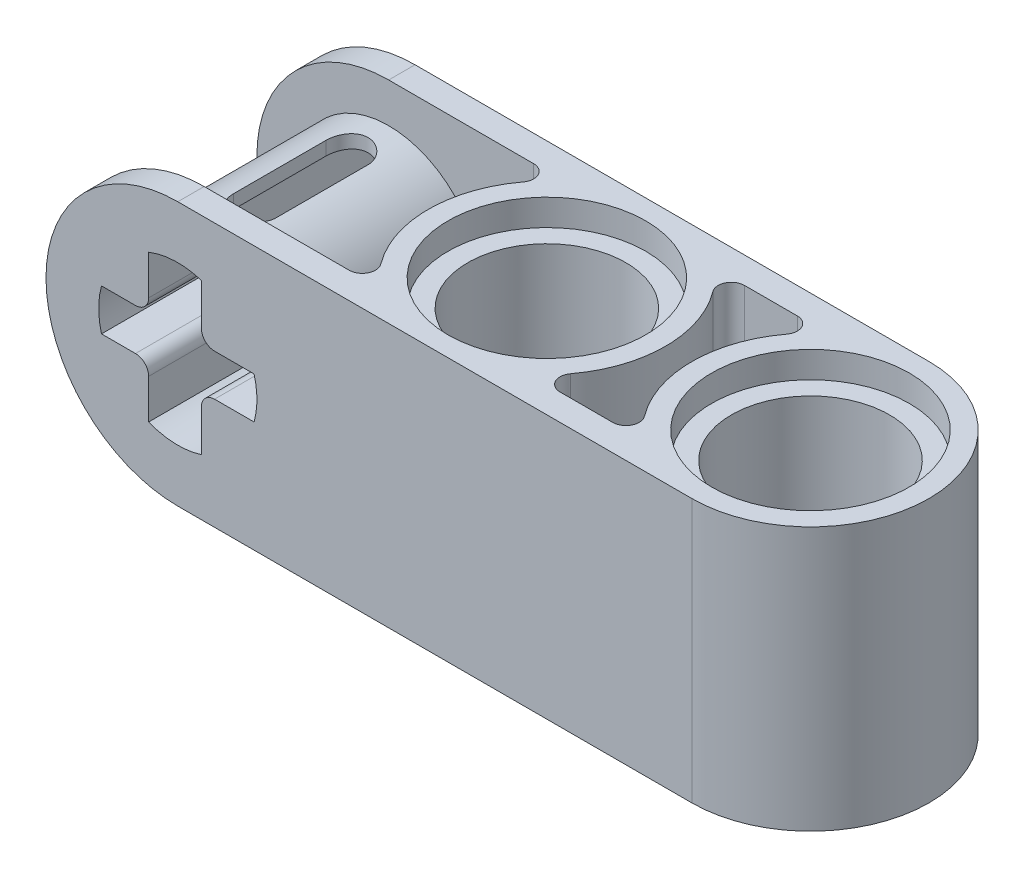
ISO-10303-21;
HEADER;
FILE_DESCRIPTION(('STEP AP214'),'2;1');
FILE_NAME('part.step','',(''),(''),'','','');
FILE_SCHEMA(('AUTOMOTIVE_DESIGN { 1 0 10303 214 1 1 1 1 }'));
ENDSEC;
DATA;
#1=APPLICATION_CONTEXT('core data for automotive mechanical design processes');
#2=APPLICATION_PROTOCOL_DEFINITION('international standard','automotive_design',2000,#1);
#3=PRODUCT_CONTEXT('',#1,'mechanical');
#4=PRODUCT('Part','Part','',(#3));
#5=PRODUCT_RELATED_PRODUCT_CATEGORY('part','',(#4));
#6=PRODUCT_DEFINITION_FORMATION('','',#4);
#7=PRODUCT_DEFINITION_CONTEXT('part definition',#1,'design');
#8=PRODUCT_DEFINITION('design','',#6,#7);
#9=PRODUCT_DEFINITION_SHAPE('','',#8);
#10=(LENGTH_UNIT() NAMED_UNIT(*) SI_UNIT(.MILLI.,.METRE.));
#11=(NAMED_UNIT(*) PLANE_ANGLE_UNIT() SI_UNIT($,.RADIAN.));
#12=(NAMED_UNIT(*) SI_UNIT($,.STERADIAN.) SOLID_ANGLE_UNIT());
#13=UNCERTAINTY_MEASURE_WITH_UNIT(LENGTH_MEASURE(1.E-05),#10,'distance_accuracy_value','');
#14=(GEOMETRIC_REPRESENTATION_CONTEXT(3) GLOBAL_UNCERTAINTY_ASSIGNED_CONTEXT((#13)) GLOBAL_UNIT_ASSIGNED_CONTEXT((#10,
#11,#12)) REPRESENTATION_CONTEXT('',''));
#15=CARTESIAN_POINT('',(0.,0.,0.));
#16=DIRECTION('',(0.,0.,1.));
#17=DIRECTION('',(1.,0.,0.));
#18=AXIS2_PLACEMENT_3D('',#15,#16,#17);
#19=CARTESIAN_POINT('',(-7.6,0.,3.6));
#20=DIRECTION('',(0.,0.,-1.));
#21=DIRECTION('',(-1.,0.,0.));
#22=AXIS2_PLACEMENT_3D('',#19,#20,#21);
#23=CYLINDRICAL_SURFACE('',#22,4.);
#24=DIRECTION('',(0.,0.,1.));
#25=VECTOR('',#24,1.);
#26=CARTESIAN_POINT('',(-7.6,-4.,-3.6));
#27=LINE('',#26,#25);
#28=CARTESIAN_POINT('',(-7.6,-4.,-3.6));
#29=VERTEX_POINT('',#28);
#30=CARTESIAN_POINT('',(-7.6,-4.,-2.8));
#31=VERTEX_POINT('',#30);
#32=EDGE_CURVE('E845',#29,#31,#27,.T.);
#33=ORIENTED_EDGE('',*,*,#32,.T.);
#34=CARTESIAN_POINT('',(-7.6,0.,-2.8));
#35=DIRECTION('',(0.,0.,-1.));
#36=DIRECTION('',(-1.,0.,0.));
#37=AXIS2_PLACEMENT_3D('',#34,#35,#36);
#38=CIRCLE('',#37,4.);
#39=CARTESIAN_POINT('',(-7.6,4.,-2.8));
#40=VERTEX_POINT('',#39);
#41=EDGE_CURVE('E893',#31,#40,#38,.T.);
#42=ORIENTED_EDGE('',*,*,#41,.T.);
#43=DIRECTION('',(0.,0.,1.));
#44=VECTOR('',#43,1.);
#45=CARTESIAN_POINT('',(-7.6,4.,-3.6));
#46=LINE('',#45,#44);
#47=CARTESIAN_POINT('',(-7.6,4.,-3.6));
#48=VERTEX_POINT('',#47);
#49=EDGE_CURVE('E849',#48,#40,#46,.T.);
#50=ORIENTED_EDGE('',*,*,#49,.F.);
#51=CARTESIAN_POINT('',(-7.6,0.,-3.6));
#52=DIRECTION('',(0.,0.,1.));
#53=DIRECTION('',(1.,0.,0.));
#54=AXIS2_PLACEMENT_3D('',#51,#52,#53);
#55=CIRCLE('',#54,4.);
#56=EDGE_CURVE('E852',#48,#29,#55,.T.);
#57=ORIENTED_EDGE('',*,*,#56,.T.);
#58=EDGE_LOOP('',(#33,#42,#50,#57));
#59=FACE_BOUND('',#58,.T.);
#60=ADVANCED_FACE('F34',(#59),#23,.T.);
#61=CARTESIAN_POINT('',(-8.,4.,-3.6));
#62=DIRECTION('',(0.,0.,1.));
#63=DIRECTION('',(1.,0.,0.));
#64=AXIS2_PLACEMENT_3D('',#61,#62,#63);
#65=PLANE('',#64);
#66=DIRECTION('',(-1.,0.,0.));
#67=VECTOR('',#66,1.);
#68=CARTESIAN_POINT('',(-8.,-4.,-3.6));
#69=LINE('',#68,#67);
#70=CARTESIAN_POINT('',(8.,-4.,-3.6));
#71=VERTEX_POINT('',#70);
#72=EDGE_CURVE('E884',#71,#29,#69,.T.);
#73=ORIENTED_EDGE('',*,*,#72,.T.);
#74=ORIENTED_EDGE('',*,*,#56,.F.);
#75=DIRECTION('',(-1.,0.,0.));
#76=VECTOR('',#75,1.);
#77=CARTESIAN_POINT('',(-8.,4.,-3.6));
#78=LINE('',#77,#76);
#79=CARTESIAN_POINT('',(8.,4.,-3.6));
#80=VERTEX_POINT('',#79);
#81=EDGE_CURVE('E874',#80,#48,#78,.T.);
#82=ORIENTED_EDGE('',*,*,#81,.F.);
#83=DIRECTION('',(0.,-1.,0.));
#84=VECTOR('',#83,1.);
#85=CARTESIAN_POINT('',(8.,4.,-3.6));
#86=LINE('',#85,#84);
#87=EDGE_CURVE('E890',#80,#71,#86,.T.);
#88=ORIENTED_EDGE('',*,*,#87,.T.);
#89=EDGE_LOOP('',(#73,#74,#82,#88));
#90=FACE_BOUND('',#89,.T.);
#91=DIRECTION('',(1.,0.,0.));
#92=VECTOR('',#91,1.);
#93=CARTESIAN_POINT('',(-9.91554175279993,-0.631083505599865,-3.6));
#94=LINE('',#93,#92);
#95=CARTESIAN_POINT('',(-9.91554175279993,-0.631083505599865,-3.6));
#96=VERTEX_POINT('',#95);
#97=CARTESIAN_POINT('',(-8.88445824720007,-0.631083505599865,-3.6));
#98=VERTEX_POINT('',#97);
#99=EDGE_CURVE('E602',#96,#98,#94,.T.);
#100=ORIENTED_EDGE('',*,*,#99,.T.);
#101=CARTESIAN_POINT('',(-8.88445824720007,-1.03108350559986,-3.6));
#102=DIRECTION('',(0.,0.,1.));
#103=DIRECTION('',(1.,0.,0.));
#104=AXIS2_PLACEMENT_3D('',#101,#102,#103);
#105=CIRCLE('',#104,0.4);
#106=CARTESIAN_POINT('',(-8.48445824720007,-1.03108350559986,-3.6));
#107=VERTEX_POINT('',#106);
#108=EDGE_CURVE('E521',#98,#107,#105,.F.);
#109=ORIENTED_EDGE('',*,*,#108,.T.);
#110=DIRECTION('',(0.,1.,0.));
#111=VECTOR('',#110,1.);
#112=CARTESIAN_POINT('',(-8.48445824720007,-2.23108350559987,-3.6));
#113=LINE('',#112,#111);
#114=CARTESIAN_POINT('',(-8.48445824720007,-2.23108350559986,-3.6));
#115=VERTEX_POINT('',#114);
#116=EDGE_CURVE('E599',#115,#107,#113,.T.);
#117=ORIENTED_EDGE('',*,*,#116,.F.);
#118=CARTESIAN_POINT('',(-7.6,0.,-3.6));
#119=DIRECTION('',(0.,0.,1.));
#120=DIRECTION('',(1.,0.,0.));
#121=AXIS2_PLACEMENT_3D('',#118,#119,#120);
#122=CIRCLE('',#121,2.4);
#123=CARTESIAN_POINT('',(-6.88445824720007,-2.29085137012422,-3.6));
#124=VERTEX_POINT('',#123);
#125=EDGE_CURVE('E596',#115,#124,#122,.T.);
#126=ORIENTED_EDGE('',*,*,#125,.T.);
#127=DIRECTION('',(0.,1.,0.));
#128=VECTOR('',#127,1.);
#129=CARTESIAN_POINT('',(-6.88445824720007,-2.29085137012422,-3.6));
#130=LINE('',#129,#128);
#131=CARTESIAN_POINT('',(-6.88445824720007,-1.03108350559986,-3.6));
#132=VERTEX_POINT('',#131);
#133=EDGE_CURVE('E593',#124,#132,#130,.T.);
#134=ORIENTED_EDGE('',*,*,#133,.T.);
#135=CARTESIAN_POINT('',(-6.48445824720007,-1.03108350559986,-3.6));
#136=DIRECTION('',(0.,0.,1.));
#137=DIRECTION('',(1.,0.,0.));
#138=AXIS2_PLACEMENT_3D('',#135,#136,#137);
#139=CIRCLE('',#138,0.4);
#140=CARTESIAN_POINT('',(-6.48445824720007,-0.631083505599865,-3.6));
#141=VERTEX_POINT('',#140);
#142=EDGE_CURVE('E519',#132,#141,#139,.F.);
#143=ORIENTED_EDGE('',*,*,#142,.T.);
#144=DIRECTION('',(1.,0.,0.));
#145=VECTOR('',#144,1.);
#146=CARTESIAN_POINT('',(-6.88445824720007,-0.631083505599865,-3.6));
#147=LINE('',#146,#145);
#148=CARTESIAN_POINT('',(-5.28445824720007,-0.631083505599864,-3.6));
#149=VERTEX_POINT('',#148);
#150=EDGE_CURVE('E591',#141,#149,#147,.T.);
#151=ORIENTED_EDGE('',*,*,#150,.T.);
#152=CARTESIAN_POINT('',(-7.6,0.,-3.6));
#153=DIRECTION('',(0.,0.,1.));
#154=DIRECTION('',(1.,0.,0.));
#155=AXIS2_PLACEMENT_3D('',#152,#153,#154);
#156=CIRCLE('',#155,2.4);
#157=CARTESIAN_POINT('',(-5.28445824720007,0.631083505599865,-3.6));
#158=VERTEX_POINT('',#157);
#159=EDGE_CURVE('E588',#149,#158,#156,.T.);
#160=ORIENTED_EDGE('',*,*,#159,.T.);
#161=DIRECTION('',(1.,0.,0.));
#162=VECTOR('',#161,1.);
#163=CARTESIAN_POINT('',(-6.88445824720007,0.631083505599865,-3.6));
#164=LINE('',#163,#162);
#165=CARTESIAN_POINT('',(-6.48445824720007,0.631083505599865,-3.6));
#166=VERTEX_POINT('',#165);
#167=EDGE_CURVE('E586',#166,#158,#164,.T.);
#168=ORIENTED_EDGE('',*,*,#167,.F.);
#169=CARTESIAN_POINT('',(-6.48445824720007,1.03108350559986,-3.6));
#170=DIRECTION('',(0.,0.,1.));
#171=DIRECTION('',(1.,0.,0.));
#172=AXIS2_PLACEMENT_3D('',#169,#170,#171);
#173=CIRCLE('',#172,0.4);
#174=CARTESIAN_POINT('',(-6.88445824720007,1.03108350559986,-3.6));
#175=VERTEX_POINT('',#174);
#176=EDGE_CURVE('E55',#166,#175,#173,.F.);
#177=ORIENTED_EDGE('',*,*,#176,.T.);
#178=DIRECTION('',(0.,1.,0.));
#179=VECTOR('',#178,1.);
#180=CARTESIAN_POINT('',(-6.88445824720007,0.631083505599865,-3.6));
#181=LINE('',#180,#179);
#182=CARTESIAN_POINT('',(-6.88445824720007,2.29085137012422,-3.6));
#183=VERTEX_POINT('',#182);
#184=EDGE_CURVE('E584',#175,#183,#181,.T.);
#185=ORIENTED_EDGE('',*,*,#184,.T.);
#186=CARTESIAN_POINT('',(-7.6,0.,-3.6));
#187=DIRECTION('',(0.,0.,1.));
#188=DIRECTION('',(1.,0.,0.));
#189=AXIS2_PLACEMENT_3D('',#186,#187,#188);
#190=CIRCLE('',#189,2.4);
#191=CARTESIAN_POINT('',(-8.48445824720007,2.23108350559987,-3.6));
#192=VERTEX_POINT('',#191);
#193=EDGE_CURVE('E581',#183,#192,#190,.T.);
#194=ORIENTED_EDGE('',*,*,#193,.T.);
#195=DIRECTION('',(0.,1.,0.));
#196=VECTOR('',#195,1.);
#197=CARTESIAN_POINT('',(-8.48445824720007,0.631083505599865,-3.6));
#198=LINE('',#197,#196);
#199=CARTESIAN_POINT('',(-8.48445824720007,1.03108350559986,-3.6));
#200=VERTEX_POINT('',#199);
#201=EDGE_CURVE('E579',#200,#192,#198,.T.);
#202=ORIENTED_EDGE('',*,*,#201,.F.);
#203=CARTESIAN_POINT('',(-8.88445824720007,1.03108350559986,-3.6));
#204=DIRECTION('',(0.,0.,1.));
#205=DIRECTION('',(1.,0.,0.));
#206=AXIS2_PLACEMENT_3D('',#203,#204,#205);
#207=CIRCLE('',#206,0.4);
#208=CARTESIAN_POINT('',(-8.88445824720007,0.631083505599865,-3.6));
#209=VERTEX_POINT('',#208);
#210=EDGE_CURVE('E516',#200,#209,#207,.F.);
#211=ORIENTED_EDGE('',*,*,#210,.T.);
#212=DIRECTION('',(1.,0.,0.));
#213=VECTOR('',#212,1.);
#214=CARTESIAN_POINT('',(-9.91554175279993,0.631083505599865,-3.6));
#215=LINE('',#214,#213);
#216=CARTESIAN_POINT('',(-9.91554175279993,0.631083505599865,-3.6));
#217=VERTEX_POINT('',#216);
#218=EDGE_CURVE('E540',#217,#209,#215,.T.);
#219=ORIENTED_EDGE('',*,*,#218,.F.);
#220=CARTESIAN_POINT('',(-7.6,0.,-3.6));
#221=DIRECTION('',(0.,0.,1.));
#222=DIRECTION('',(1.,0.,0.));
#223=AXIS2_PLACEMENT_3D('',#220,#221,#222);
#224=CIRCLE('',#223,2.4);
#225=EDGE_CURVE('E605',#217,#96,#224,.T.);
#226=ORIENTED_EDGE('',*,*,#225,.T.);
#227=EDGE_LOOP('',(#100,#109,#117,#126,#134,#143,#151,#160,#168,#177,#185,#194,#202,#211,#219,#226));
#228=FACE_BOUND('',#227,.T.);
#229=ADVANCED_FACE('F983',(#90,#228),#65,.F.);
#230=CARTESIAN_POINT('',(-8.,4.,3.6));
#231=DIRECTION('',(0.,0.,-1.));
#232=DIRECTION('',(-1.,0.,0.));
#233=AXIS2_PLACEMENT_3D('',#230,#231,#232);
#234=PLANE('',#233);
#235=CARTESIAN_POINT('',(-7.6,0.,3.6));
#236=DIRECTION('',(0.,0.,1.));
#237=DIRECTION('',(1.,0.,0.));
#238=AXIS2_PLACEMENT_3D('',#235,#236,#237);
#239=CIRCLE('',#238,4.);
#240=CARTESIAN_POINT('',(-7.6,4.,3.6));
#241=VERTEX_POINT('',#240);
#242=CARTESIAN_POINT('',(-7.6,-4.,3.6));
#243=VERTEX_POINT('',#242);
#244=EDGE_CURVE('E853',#241,#243,#239,.T.);
#245=ORIENTED_EDGE('',*,*,#244,.T.);
#246=DIRECTION('',(1.,0.,0.));
#247=VECTOR('',#246,1.);
#248=CARTESIAN_POINT('',(-8.,-4.,3.6));
#249=LINE('',#248,#247);
#250=CARTESIAN_POINT('',(8.,-4.,3.6));
#251=VERTEX_POINT('',#250);
#252=EDGE_CURVE('E875',#243,#251,#249,.T.);
#253=ORIENTED_EDGE('',*,*,#252,.T.);
#254=DIRECTION('',(0.,-1.,0.));
#255=VECTOR('',#254,1.);
#256=CARTESIAN_POINT('',(8.,4.,3.6));
#257=LINE('',#256,#255);
#258=CARTESIAN_POINT('',(8.,4.,3.6));
#259=VERTEX_POINT('',#258);
#260=EDGE_CURVE('E880',#259,#251,#257,.T.);
#261=ORIENTED_EDGE('',*,*,#260,.F.);
#262=DIRECTION('',(1.,0.,0.));
#263=VECTOR('',#262,1.);
#264=CARTESIAN_POINT('',(-8.,4.,3.6));
#265=LINE('',#264,#263);
#266=EDGE_CURVE('E878',#241,#259,#265,.T.);
#267=ORIENTED_EDGE('',*,*,#266,.F.);
#268=EDGE_LOOP('',(#245,#253,#261,#267));
#269=FACE_BOUND('',#268,.T.);
#270=DIRECTION('',(0.,1.,0.));
#271=VECTOR('',#270,1.);
#272=CARTESIAN_POINT('',(-8.48445824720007,-2.23108350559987,3.6));
#273=LINE('',#272,#271);
#274=CARTESIAN_POINT('',(-8.48445824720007,-2.23108350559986,3.6));
#275=VERTEX_POINT('',#274);
#276=CARTESIAN_POINT('',(-8.48445824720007,-1.03108350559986,3.6));
#277=VERTEX_POINT('',#276);
#278=EDGE_CURVE('E572',#275,#277,#273,.T.);
#279=ORIENTED_EDGE('',*,*,#278,.T.);
#280=CARTESIAN_POINT('',(-8.88445824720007,-1.03108350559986,3.6));
#281=DIRECTION('',(0.,0.,-1.));
#282=DIRECTION('',(-1.,0.,0.));
#283=AXIS2_PLACEMENT_3D('',#280,#281,#282);
#284=CIRCLE('',#283,0.4);
#285=CARTESIAN_POINT('',(-8.88445824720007,-0.631083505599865,3.6));
#286=VERTEX_POINT('',#285);
#287=EDGE_CURVE('E512',#277,#286,#284,.F.);
#288=ORIENTED_EDGE('',*,*,#287,.T.);
#289=DIRECTION('',(1.,0.,0.));
#290=VECTOR('',#289,1.);
#291=CARTESIAN_POINT('',(-9.91554175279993,-0.631083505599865,3.6));
#292=LINE('',#291,#290);
#293=CARTESIAN_POINT('',(-9.91554175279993,-0.631083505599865,3.6));
#294=VERTEX_POINT('',#293);
#295=EDGE_CURVE('E574',#294,#286,#292,.T.);
#296=ORIENTED_EDGE('',*,*,#295,.F.);
#297=CARTESIAN_POINT('',(-7.6,0.,3.6));
#298=DIRECTION('',(0.,0.,1.));
#299=DIRECTION('',(1.,0.,0.));
#300=AXIS2_PLACEMENT_3D('',#297,#298,#299);
#301=CIRCLE('',#300,2.4);
#302=CARTESIAN_POINT('',(-9.91554175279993,0.631083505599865,3.6));
#303=VERTEX_POINT('',#302);
#304=EDGE_CURVE('E549',#303,#294,#301,.T.);
#305=ORIENTED_EDGE('',*,*,#304,.F.);
#306=DIRECTION('',(1.,0.,0.));
#307=VECTOR('',#306,1.);
#308=CARTESIAN_POINT('',(-9.91554175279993,0.631083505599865,3.6));
#309=LINE('',#308,#307);
#310=CARTESIAN_POINT('',(-8.88445824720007,0.631083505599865,3.6));
#311=VERTEX_POINT('',#310);
#312=EDGE_CURVE('E537',#303,#311,#309,.T.);
#313=ORIENTED_EDGE('',*,*,#312,.T.);
#314=CARTESIAN_POINT('',(-8.88445824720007,1.03108350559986,3.6));
#315=DIRECTION('',(0.,0.,-1.));
#316=DIRECTION('',(-1.,0.,0.));
#317=AXIS2_PLACEMENT_3D('',#314,#315,#316);
#318=CIRCLE('',#317,0.4);
#319=CARTESIAN_POINT('',(-8.48445824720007,1.03108350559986,3.6));
#320=VERTEX_POINT('',#319);
#321=EDGE_CURVE('E506',#311,#320,#318,.F.);
#322=ORIENTED_EDGE('',*,*,#321,.T.);
#323=DIRECTION('',(0.,1.,0.));
#324=VECTOR('',#323,1.);
#325=CARTESIAN_POINT('',(-8.48445824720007,0.631083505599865,3.6));
#326=LINE('',#325,#324);
#327=CARTESIAN_POINT('',(-8.48445824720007,2.23108350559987,3.6));
#328=VERTEX_POINT('',#327);
#329=EDGE_CURVE('E550',#320,#328,#326,.T.);
#330=ORIENTED_EDGE('',*,*,#329,.T.);
#331=CARTESIAN_POINT('',(-7.6,0.,3.6));
#332=DIRECTION('',(0.,0.,1.));
#333=DIRECTION('',(1.,0.,0.));
#334=AXIS2_PLACEMENT_3D('',#331,#332,#333);
#335=CIRCLE('',#334,2.4);
#336=CARTESIAN_POINT('',(-6.88445824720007,2.29085137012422,3.6));
#337=VERTEX_POINT('',#336);
#338=EDGE_CURVE('E551',#337,#328,#335,.T.);
#339=ORIENTED_EDGE('',*,*,#338,.F.);
#340=DIRECTION('',(0.,1.,0.));
#341=VECTOR('',#340,1.);
#342=CARTESIAN_POINT('',(-6.88445824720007,0.631083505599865,3.6));
#343=LINE('',#342,#341);
#344=CARTESIAN_POINT('',(-6.88445824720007,1.03108350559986,3.6));
#345=VERTEX_POINT('',#344);
#346=EDGE_CURVE('E557',#345,#337,#343,.T.);
#347=ORIENTED_EDGE('',*,*,#346,.F.);
#348=CARTESIAN_POINT('',(-6.48445824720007,1.03108350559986,3.6));
#349=DIRECTION('',(0.,0.,-1.));
#350=DIRECTION('',(-1.,0.,0.));
#351=AXIS2_PLACEMENT_3D('',#348,#349,#350);
#352=CIRCLE('',#351,0.4);
#353=CARTESIAN_POINT('',(-6.48445824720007,0.631083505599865,3.6));
#354=VERTEX_POINT('',#353);
#355=EDGE_CURVE('E508',#345,#354,#352,.F.);
#356=ORIENTED_EDGE('',*,*,#355,.T.);
#357=DIRECTION('',(1.,0.,0.));
#358=VECTOR('',#357,1.);
#359=CARTESIAN_POINT('',(-6.88445824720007,0.631083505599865,3.6));
#360=LINE('',#359,#358);
#361=CARTESIAN_POINT('',(-5.28445824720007,0.631083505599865,3.6));
#362=VERTEX_POINT('',#361);
#363=EDGE_CURVE('E559',#354,#362,#360,.T.);
#364=ORIENTED_EDGE('',*,*,#363,.T.);
#365=CARTESIAN_POINT('',(-7.6,0.,3.6));
#366=DIRECTION('',(0.,0.,1.));
#367=DIRECTION('',(1.,0.,0.));
#368=AXIS2_PLACEMENT_3D('',#365,#366,#367);
#369=CIRCLE('',#368,2.4);
#370=CARTESIAN_POINT('',(-5.28445824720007,-0.631083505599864,3.6));
#371=VERTEX_POINT('',#370);
#372=EDGE_CURVE('E561',#371,#362,#369,.T.);
#373=ORIENTED_EDGE('',*,*,#372,.F.);
#374=DIRECTION('',(1.,0.,0.));
#375=VECTOR('',#374,1.);
#376=CARTESIAN_POINT('',(-6.88445824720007,-0.631083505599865,3.6));
#377=LINE('',#376,#375);
#378=CARTESIAN_POINT('',(-6.48445824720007,-0.631083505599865,3.6));
#379=VERTEX_POINT('',#378);
#380=EDGE_CURVE('E564',#379,#371,#377,.T.);
#381=ORIENTED_EDGE('',*,*,#380,.F.);
#382=CARTESIAN_POINT('',(-6.48445824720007,-1.03108350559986,3.6));
#383=DIRECTION('',(0.,0.,-1.));
#384=DIRECTION('',(-1.,0.,0.));
#385=AXIS2_PLACEMENT_3D('',#382,#383,#384);
#386=CIRCLE('',#385,0.4);
#387=CARTESIAN_POINT('',(-6.88445824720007,-1.03108350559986,3.6));
#388=VERTEX_POINT('',#387);
#389=EDGE_CURVE('E510',#379,#388,#386,.F.);
#390=ORIENTED_EDGE('',*,*,#389,.T.);
#391=DIRECTION('',(0.,1.,0.));
#392=VECTOR('',#391,1.);
#393=CARTESIAN_POINT('',(-6.88445824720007,-2.29085137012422,3.6));
#394=LINE('',#393,#392);
#395=CARTESIAN_POINT('',(-6.88445824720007,-2.29085137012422,3.6));
#396=VERTEX_POINT('',#395);
#397=EDGE_CURVE('E566',#396,#388,#394,.T.);
#398=ORIENTED_EDGE('',*,*,#397,.F.);
#399=CARTESIAN_POINT('',(-7.6,0.,3.6));
#400=DIRECTION('',(0.,0.,1.));
#401=DIRECTION('',(1.,0.,0.));
#402=AXIS2_PLACEMENT_3D('',#399,#400,#401);
#403=CIRCLE('',#402,2.4);
#404=EDGE_CURVE('E569',#275,#396,#403,.T.);
#405=ORIENTED_EDGE('',*,*,#404,.F.);
#406=EDGE_LOOP('',(#279,#288,#296,#305,#313,#322,#330,#339,#347,#356,#364,#373,#381,#390,#398,#405));
#407=FACE_BOUND('',#406,.T.);
#408=ADVANCED_FACE('F546',(#269,#407),#234,.F.);
#409=CARTESIAN_POINT('',(0.,0.8,0.));
#410=DIRECTION('',(0.,-1.,0.));
#411=DIRECTION('',(0.,0.,-1.));
#412=AXIS2_PLACEMENT_3D('',#409,#410,#411);
#413=PLANE('',#412);
#414=DIRECTION('',(0.,0.,-1.));
#415=VECTOR('',#414,1.);
#416=CARTESIAN_POINT('',(-4.91671842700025,0.8,3.6));
#417=LINE('',#416,#415);
#418=CARTESIAN_POINT('',(-4.91671842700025,0.8,2.8));
#419=VERTEX_POINT('',#418);
#420=CARTESIAN_POINT('',(-4.91671842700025,0.8,-2.8));
#421=VERTEX_POINT('',#420);
#422=EDGE_CURVE('E628',#419,#421,#417,.T.);
#423=ORIENTED_EDGE('',*,*,#422,.F.);
#424=DIRECTION('',(1.,0.,0.));
#425=VECTOR('',#424,1.);
#426=CARTESIAN_POINT('',(-11.6,0.8,2.8));
#427=LINE('',#426,#425);
#428=CARTESIAN_POINT('',(-3.2,0.8,2.8));
#429=VERTEX_POINT('',#428);
#430=EDGE_CURVE('E753',#419,#429,#427,.T.);
#431=ORIENTED_EDGE('',*,*,#430,.T.);
#432=CARTESIAN_POINT('',(-3.2,0.8,2.4));
#433=DIRECTION('',(0.,1.,0.));
#434=DIRECTION('',(0.,0.,1.));
#435=AXIS2_PLACEMENT_3D('',#432,#433,#434);
#436=CIRCLE('',#435,0.4);
#437=CARTESIAN_POINT('',(-2.88,0.8,2.16));
#438=VERTEX_POINT('',#437);
#439=EDGE_CURVE('E755',#429,#438,#436,.T.);
#440=ORIENTED_EDGE('',*,*,#439,.T.);
#441=CARTESIAN_POINT('',(0.,0.8,0.));
#442=DIRECTION('',(0.,-1.,0.));
#443=DIRECTION('',(0.,0.,-1.));
#444=AXIS2_PLACEMENT_3D('',#441,#442,#443);
#445=CIRCLE('',#444,3.6);
#446=CARTESIAN_POINT('',(-2.88,0.8,-2.16));
#447=VERTEX_POINT('',#446);
#448=EDGE_CURVE('E744',#438,#447,#445,.T.);
#449=ORIENTED_EDGE('',*,*,#448,.T.);
#450=CARTESIAN_POINT('',(-3.2,0.8,-2.4));
#451=DIRECTION('',(0.,1.,0.));
#452=DIRECTION('',(0.,0.,1.));
#453=AXIS2_PLACEMENT_3D('',#450,#451,#452);
#454=CIRCLE('',#453,0.4);
#455=CARTESIAN_POINT('',(-3.2,0.8,-2.8));
#456=VERTEX_POINT('',#455);
#457=EDGE_CURVE('E747',#447,#456,#454,.T.);
#458=ORIENTED_EDGE('',*,*,#457,.T.);
#459=DIRECTION('',(-1.,0.,0.));
#460=VECTOR('',#459,1.);
#461=CARTESIAN_POINT('',(-3.2,0.8,-2.8));
#462=LINE('',#461,#460);
#463=EDGE_CURVE('E751',#456,#421,#462,.T.);
#464=ORIENTED_EDGE('',*,*,#463,.T.);
#465=EDGE_LOOP('',(#423,#431,#440,#449,#458,#464));
#466=FACE_BOUND('',#465,.T.);
#467=ADVANCED_FACE('F938',(#466),#413,.F.);
#468=CARTESIAN_POINT('',(0.,-0.8,0.));
#469=DIRECTION('',(0.,1.,0.));
#470=DIRECTION('',(0.,0.,-1.));
#471=AXIS2_PLACEMENT_3D('',#468,#469,#470);
#472=PLANE('',#471);
#473=DIRECTION('',(0.,0.,-1.));
#474=VECTOR('',#473,1.);
#475=CARTESIAN_POINT('',(-4.91671842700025,-0.8,3.6));
#476=LINE('',#475,#474);
#477=CARTESIAN_POINT('',(-4.91671842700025,-0.8,-2.8));
#478=VERTEX_POINT('',#477);
#479=CARTESIAN_POINT('',(-4.91671842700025,-0.8,2.8));
#480=VERTEX_POINT('',#479);
#481=EDGE_CURVE('E398',#478,#480,#476,.F.);
#482=ORIENTED_EDGE('',*,*,#481,.F.);
#483=DIRECTION('',(-1.,0.,0.));
#484=VECTOR('',#483,1.);
#485=CARTESIAN_POINT('',(-3.2,-0.8,-2.8));
#486=LINE('',#485,#484);
#487=CARTESIAN_POINT('',(-3.2,-0.8,-2.8));
#488=VERTEX_POINT('',#487);
#489=EDGE_CURVE('E644',#488,#478,#486,.T.);
#490=ORIENTED_EDGE('',*,*,#489,.F.);
#491=CARTESIAN_POINT('',(-3.2,-0.8,-2.4));
#492=DIRECTION('',(0.,1.,0.));
#493=DIRECTION('',(0.,0.,1.));
#494=AXIS2_PLACEMENT_3D('',#491,#492,#493);
#495=CIRCLE('',#494,0.4);
#496=CARTESIAN_POINT('',(-2.88,-0.8,-2.16));
#497=VERTEX_POINT('',#496);
#498=EDGE_CURVE('E647',#497,#488,#495,.T.);
#499=ORIENTED_EDGE('',*,*,#498,.F.);
#500=CARTESIAN_POINT('',(0.,-0.8,0.));
#501=DIRECTION('',(0.,-1.,0.));
#502=DIRECTION('',(0.,0.,-1.));
#503=AXIS2_PLACEMENT_3D('',#500,#501,#502);
#504=CIRCLE('',#503,3.6);
#505=CARTESIAN_POINT('',(-2.88,-0.8,2.16));
#506=VERTEX_POINT('',#505);
#507=EDGE_CURVE('E636',#506,#497,#504,.T.);
#508=ORIENTED_EDGE('',*,*,#507,.F.);
#509=CARTESIAN_POINT('',(-3.2,-0.8,2.4));
#510=DIRECTION('',(0.,1.,0.));
#511=DIRECTION('',(0.,0.,1.));
#512=AXIS2_PLACEMENT_3D('',#509,#510,#511);
#513=CIRCLE('',#512,0.4);
#514=CARTESIAN_POINT('',(-3.2,-0.8,2.8));
#515=VERTEX_POINT('',#514);
#516=EDGE_CURVE('E639',#515,#506,#513,.T.);
#517=ORIENTED_EDGE('',*,*,#516,.F.);
#518=DIRECTION('',(1.,0.,0.));
#519=VECTOR('',#518,1.);
#520=CARTESIAN_POINT('',(-11.6,-0.8,2.8));
#521=LINE('',#520,#519);
#522=EDGE_CURVE('E642',#480,#515,#521,.T.);
#523=ORIENTED_EDGE('',*,*,#522,.F.);
#524=EDGE_LOOP('',(#482,#490,#499,#508,#517,#523));
#525=FACE_BOUND('',#524,.T.);
#526=ADVANCED_FACE('F465',(#525),#472,.F.);
#527=CARTESIAN_POINT('',(-7.6,0.,2.8));
#528=DIRECTION('',(0.,0.,1.));
#529=DIRECTION('',(1.,0.,0.));
#530=AXIS2_PLACEMENT_3D('',#527,#528,#529);
#531=CIRCLE('',#530,4.);
#532=CARTESIAN_POINT('',(-7.6,4.,2.8));
#533=VERTEX_POINT('',#532);
#534=CARTESIAN_POINT('',(-7.6,-4.,2.8));
#535=VERTEX_POINT('',#534);
#536=EDGE_CURVE('E899',#533,#535,#531,.T.);
#537=ORIENTED_EDGE('',*,*,#536,.T.);
#538=EDGE_CURVE('E830',#535,#243,#27,.T.);
#539=ORIENTED_EDGE('',*,*,#538,.T.);
#540=ORIENTED_EDGE('',*,*,#244,.F.);
#541=EDGE_CURVE('E848',#533,#241,#46,.T.);
#542=ORIENTED_EDGE('',*,*,#541,.F.);
#543=EDGE_LOOP('',(#537,#539,#540,#542));
#544=FACE_BOUND('',#543,.T.);
#545=ADVANCED_FACE('F959',(#544),#23,.T.);
#546=CARTESIAN_POINT('',(8.,-4.,0.));
#547=DIRECTION('',(0.,1.,0.));
#548=DIRECTION('',(0.,0.,1.));
#549=AXIS2_PLACEMENT_3D('',#546,#547,#548);
#550=CYLINDRICAL_SURFACE('',#549,2.4);
#551=CARTESIAN_POINT('',(8.,3.2,0.));
#552=DIRECTION('',(0.,1.,0.));
#553=DIRECTION('',(0.,0.,1.));
#554=AXIS2_PLACEMENT_3D('',#551,#552,#553);
#555=CIRCLE('',#554,2.4);
#556=CARTESIAN_POINT('',(8.,3.2,2.4));
#557=VERTEX_POINT('',#556);
#558=EDGE_CURVE('E861',#557,#557,#555,.F.);
#559=ORIENTED_EDGE('',*,*,#558,.F.);
#560=EDGE_LOOP('',(#559));
#561=FACE_BOUND('',#560,.T.);
#562=CARTESIAN_POINT('',(8.,-3.2,0.));
#563=DIRECTION('',(0.,-1.,0.));
#564=DIRECTION('',(0.,0.,-1.));
#565=AXIS2_PLACEMENT_3D('',#562,#563,#564);
#566=CIRCLE('',#565,2.4);
#567=CARTESIAN_POINT('',(8.,-3.2,-2.4));
#568=VERTEX_POINT('',#567);
#569=EDGE_CURVE('E734',#568,#568,#566,.F.);
#570=ORIENTED_EDGE('',*,*,#569,.F.);
#571=EDGE_LOOP('',(#570));
#572=FACE_BOUND('',#571,.T.);
#573=ADVANCED_FACE('F993',(#561,#572),#550,.F.);
#574=CARTESIAN_POINT('',(0.,-4.,0.));
#575=DIRECTION('',(0.,1.,0.));
#576=DIRECTION('',(0.,0.,1.));
#577=AXIS2_PLACEMENT_3D('',#574,#575,#576);
#578=CYLINDRICAL_SURFACE('',#577,2.4);
#579=CARTESIAN_POINT('',(0.,3.2,0.));
#580=DIRECTION('',(0.,1.,0.));
#581=DIRECTION('',(0.,0.,1.));
#582=AXIS2_PLACEMENT_3D('',#579,#580,#581);
#583=CIRCLE('',#582,2.4);
#584=CARTESIAN_POINT('',(0.,3.2,2.4));
#585=VERTEX_POINT('',#584);
#586=EDGE_CURVE('E867',#585,#585,#583,.F.);
#587=ORIENTED_EDGE('',*,*,#586,.F.);
#588=EDGE_LOOP('',(#587));
#589=FACE_BOUND('',#588,.T.);
#590=CARTESIAN_POINT('',(0.,-3.2,0.));
#591=DIRECTION('',(0.,-1.,0.));
#592=DIRECTION('',(0.,0.,-1.));
#593=AXIS2_PLACEMENT_3D('',#590,#591,#592);
#594=CIRCLE('',#593,2.4);
#595=CARTESIAN_POINT('',(0.,-3.2,-2.4));
#596=VERTEX_POINT('',#595);
#597=EDGE_CURVE('E740',#596,#596,#594,.F.);
#598=ORIENTED_EDGE('',*,*,#597,.F.);
#599=EDGE_LOOP('',(#598));
#600=FACE_BOUND('',#599,.T.);
#601=ADVANCED_FACE('F998',(#589,#600),#578,.F.);
#602=CARTESIAN_POINT('',(8.,-4.,0.));
#603=DIRECTION('',(0.,1.,0.));
#604=DIRECTION('',(0.,0.,1.));
#605=AXIS2_PLACEMENT_3D('',#602,#603,#604);
#606=PLANE('',#605);
#607=DIRECTION('',(-1.,0.,0.));
#608=VECTOR('',#607,1.);
#609=CARTESIAN_POINT('',(-3.2,-4.,-2.8));
#610=LINE('',#609,#608);
#611=CARTESIAN_POINT('',(-3.2,-4.,-2.8));
#612=VERTEX_POINT('',#611);
#613=EDGE_CURVE('E658',#612,#31,#610,.T.);
#614=ORIENTED_EDGE('',*,*,#613,.T.);
#615=ORIENTED_EDGE('',*,*,#32,.F.);
#616=ORIENTED_EDGE('',*,*,#72,.F.);
#617=CARTESIAN_POINT('',(8.,-4.,0.));
#618=DIRECTION('',(0.,1.,0.));
#619=DIRECTION('',(0.,0.,1.));
#620=AXIS2_PLACEMENT_3D('',#617,#618,#619);
#621=CIRCLE('',#620,3.6);
#622=EDGE_CURVE('E881',#251,#71,#621,.T.);
#623=ORIENTED_EDGE('',*,*,#622,.F.);
#624=ORIENTED_EDGE('',*,*,#252,.F.);
#625=ORIENTED_EDGE('',*,*,#538,.F.);
#626=DIRECTION('',(1.,0.,0.));
#627=VECTOR('',#626,1.);
#628=CARTESIAN_POINT('',(-11.6,-4.,2.8));
#629=LINE('',#628,#627);
#630=CARTESIAN_POINT('',(-3.2,-4.,2.8));
#631=VERTEX_POINT('',#630);
#632=EDGE_CURVE('E655',#535,#631,#629,.T.);
#633=ORIENTED_EDGE('',*,*,#632,.T.);
#634=CARTESIAN_POINT('',(-3.2,-4.,2.4));
#635=DIRECTION('',(0.,1.,0.));
#636=DIRECTION('',(0.,0.,1.));
#637=AXIS2_PLACEMENT_3D('',#634,#635,#636);
#638=CIRCLE('',#637,0.4);
#639=CARTESIAN_POINT('',(-2.88,-4.,2.16));
#640=VERTEX_POINT('',#639);
#641=EDGE_CURVE('E652',#631,#640,#638,.T.);
#642=ORIENTED_EDGE('',*,*,#641,.T.);
#643=CARTESIAN_POINT('',(0.,-4.,0.));
#644=DIRECTION('',(0.,-1.,0.));
#645=DIRECTION('',(0.,0.,-1.));
#646=AXIS2_PLACEMENT_3D('',#643,#644,#645);
#647=CIRCLE('',#646,3.6);
#648=CARTESIAN_POINT('',(-2.88,-4.,-2.16));
#649=VERTEX_POINT('',#648);
#650=EDGE_CURVE('E635',#640,#649,#647,.T.);
#651=ORIENTED_EDGE('',*,*,#650,.T.);
#652=CARTESIAN_POINT('',(-3.2,-4.,-2.4));
#653=DIRECTION('',(0.,1.,0.));
#654=DIRECTION('',(0.,0.,1.));
#655=AXIS2_PLACEMENT_3D('',#652,#653,#654);
#656=CIRCLE('',#655,0.4);
#657=EDGE_CURVE('E640',#649,#612,#656,.T.);
#658=ORIENTED_EDGE('',*,*,#657,.T.);
#659=EDGE_LOOP('',(#614,#615,#616,#623,#624,#625,#633,#642,#651,#658));
#660=FACE_BOUND('',#659,.T.);
#661=CARTESIAN_POINT('',(8.,-4.,0.));
#662=DIRECTION('',(0.,-1.,0.));
#663=DIRECTION('',(0.,0.,-1.));
#664=AXIS2_PLACEMENT_3D('',#661,#662,#663);
#665=CIRCLE('',#664,3.6);
#666=CARTESIAN_POINT('',(5.12,-4.,2.16));
#667=VERTEX_POINT('',#666);
#668=CARTESIAN_POINT('',(5.12,-4.,-2.16));
#669=VERTEX_POINT('',#668);
#670=EDGE_CURVE('E666',#667,#669,#665,.T.);
#671=ORIENTED_EDGE('',*,*,#670,.T.);
#672=CARTESIAN_POINT('',(4.8,-4.,-2.4));
#673=DIRECTION('',(0.,1.,0.));
#674=DIRECTION('',(0.,0.,1.));
#675=AXIS2_PLACEMENT_3D('',#672,#673,#674);
#676=CIRCLE('',#675,0.4);
#677=CARTESIAN_POINT('',(4.8,-4.,-2.8));
#678=VERTEX_POINT('',#677);
#679=EDGE_CURVE('E676',#669,#678,#676,.T.);
#680=ORIENTED_EDGE('',*,*,#679,.T.);
#681=DIRECTION('',(-1.,0.,0.));
#682=VECTOR('',#681,1.);
#683=CARTESIAN_POINT('',(4.8,-4.,-2.8));
#684=LINE('',#683,#682);
#685=CARTESIAN_POINT('',(3.2,-4.,-2.8));
#686=VERTEX_POINT('',#685);
#687=EDGE_CURVE('E708',#678,#686,#684,.T.);
#688=ORIENTED_EDGE('',*,*,#687,.T.);
#689=CARTESIAN_POINT('',(3.2,-4.,-2.4));
#690=DIRECTION('',(0.,1.,0.));
#691=DIRECTION('',(0.,0.,1.));
#692=AXIS2_PLACEMENT_3D('',#689,#690,#691);
#693=CIRCLE('',#692,0.4);
#694=CARTESIAN_POINT('',(2.88,-4.,-2.16));
#695=VERTEX_POINT('',#694);
#696=EDGE_CURVE('E705',#686,#695,#693,.T.);
#697=ORIENTED_EDGE('',*,*,#696,.T.);
#698=CARTESIAN_POINT('',(0.,-4.,0.));
#699=DIRECTION('',(0.,-1.,0.));
#700=DIRECTION('',(0.,0.,-1.));
#701=AXIS2_PLACEMENT_3D('',#698,#699,#700);
#702=CIRCLE('',#701,3.6);
#703=CARTESIAN_POINT('',(2.88,-4.,2.16));
#704=VERTEX_POINT('',#703);
#705=EDGE_CURVE('E702',#695,#704,#702,.T.);
#706=ORIENTED_EDGE('',*,*,#705,.T.);
#707=CARTESIAN_POINT('',(3.2,-4.,2.4));
#708=DIRECTION('',(0.,1.,0.));
#709=DIRECTION('',(0.,0.,1.));
#710=AXIS2_PLACEMENT_3D('',#707,#708,#709);
#711=CIRCLE('',#710,0.399999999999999);
#712=CARTESIAN_POINT('',(3.2,-4.,2.8));
#713=VERTEX_POINT('',#712);
#714=EDGE_CURVE('E699',#704,#713,#711,.T.);
#715=ORIENTED_EDGE('',*,*,#714,.T.);
#716=DIRECTION('',(1.,0.,0.));
#717=VECTOR('',#716,1.);
#718=CARTESIAN_POINT('',(3.2,-4.,2.8));
#719=LINE('',#718,#717);
#720=CARTESIAN_POINT('',(4.8,-4.,2.8));
#721=VERTEX_POINT('',#720);
#722=EDGE_CURVE('E696',#713,#721,#719,.T.);
#723=ORIENTED_EDGE('',*,*,#722,.T.);
#724=CARTESIAN_POINT('',(4.8,-4.,2.4));
#725=DIRECTION('',(0.,1.,0.));
#726=DIRECTION('',(0.,0.,1.));
#727=AXIS2_PLACEMENT_3D('',#724,#725,#726);
#728=CIRCLE('',#727,0.399999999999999);
#729=EDGE_CURVE('E693',#721,#667,#728,.T.);
#730=ORIENTED_EDGE('',*,*,#729,.T.);
#731=EDGE_LOOP('',(#671,#680,#688,#697,#706,#715,#723,#730));
#732=FACE_BOUND('',#731,.T.);
#733=CARTESIAN_POINT('',(8.,-4.,0.));
#734=DIRECTION('',(0.,1.,0.));
#735=DIRECTION('',(0.,0.,1.));
#736=AXIS2_PLACEMENT_3D('',#733,#734,#735);
#737=CIRCLE('',#736,3.);
#738=CARTESIAN_POINT('',(8.,-4.,3.));
#739=VERTEX_POINT('',#738);
#740=EDGE_CURVE('E716',#739,#739,#737,.T.);
#741=ORIENTED_EDGE('',*,*,#740,.T.);
#742=EDGE_LOOP('',(#741));
#743=FACE_BOUND('',#742,.T.);
#744=CARTESIAN_POINT('',(0.,-4.,0.));
#745=DIRECTION('',(0.,1.,0.));
#746=DIRECTION('',(0.,0.,1.));
#747=AXIS2_PLACEMENT_3D('',#744,#745,#746);
#748=CIRCLE('',#747,3.);
#749=CARTESIAN_POINT('',(0.,-4.,3.));
#750=VERTEX_POINT('',#749);
#751=EDGE_CURVE('E741',#750,#750,#748,.T.);
#752=ORIENTED_EDGE('',*,*,#751,.T.);
#753=EDGE_LOOP('',(#752));
#754=FACE_BOUND('',#753,.T.);
#755=ADVANCED_FACE('F953',(#660,#732,#743,#754),#606,.F.);
#756=CARTESIAN_POINT('',(8.,4.,0.));
#757=DIRECTION('',(0.,1.,0.));
#758=DIRECTION('',(0.,0.,1.));
#759=AXIS2_PLACEMENT_3D('',#756,#757,#758);
#760=PLANE('',#759);
#761=DIRECTION('',(1.,0.,0.));
#762=VECTOR('',#761,1.);
#763=CARTESIAN_POINT('',(-11.6,4.,2.8));
#764=LINE('',#763,#762);
#765=CARTESIAN_POINT('',(-3.2,4.,2.8));
#766=VERTEX_POINT('',#765);
#767=EDGE_CURVE('E768',#533,#766,#764,.T.);
#768=ORIENTED_EDGE('',*,*,#767,.F.);
#769=ORIENTED_EDGE('',*,*,#541,.T.);
#770=ORIENTED_EDGE('',*,*,#266,.T.);
#771=CARTESIAN_POINT('',(8.,4.,0.));
#772=DIRECTION('',(0.,1.,0.));
#773=DIRECTION('',(0.,0.,1.));
#774=AXIS2_PLACEMENT_3D('',#771,#772,#773);
#775=CIRCLE('',#774,3.6);
#776=EDGE_CURVE('E871',#259,#80,#775,.T.);
#777=ORIENTED_EDGE('',*,*,#776,.T.);
#778=ORIENTED_EDGE('',*,*,#81,.T.);
#779=ORIENTED_EDGE('',*,*,#49,.T.);
#780=DIRECTION('',(-1.,0.,0.));
#781=VECTOR('',#780,1.);
#782=CARTESIAN_POINT('',(-3.2,4.,-2.8));
#783=LINE('',#782,#781);
#784=CARTESIAN_POINT('',(-3.2,4.,-2.8));
#785=VERTEX_POINT('',#784);
#786=EDGE_CURVE('E765',#785,#40,#783,.T.);
#787=ORIENTED_EDGE('',*,*,#786,.F.);
#788=CARTESIAN_POINT('',(-3.2,4.,-2.4));
#789=DIRECTION('',(0.,1.,0.));
#790=DIRECTION('',(0.,0.,1.));
#791=AXIS2_PLACEMENT_3D('',#788,#789,#790);
#792=CIRCLE('',#791,0.4);
#793=CARTESIAN_POINT('',(-2.88,4.,-2.16));
#794=VERTEX_POINT('',#793);
#795=EDGE_CURVE('E762',#794,#785,#792,.T.);
#796=ORIENTED_EDGE('',*,*,#795,.F.);
#797=CARTESIAN_POINT('',(0.,4.,0.));
#798=DIRECTION('',(0.,-1.,0.));
#799=DIRECTION('',(0.,0.,-1.));
#800=AXIS2_PLACEMENT_3D('',#797,#798,#799);
#801=CIRCLE('',#800,3.6);
#802=CARTESIAN_POINT('',(-2.88,4.,2.16));
#803=VERTEX_POINT('',#802);
#804=EDGE_CURVE('E759',#803,#794,#801,.T.);
#805=ORIENTED_EDGE('',*,*,#804,.F.);
#806=CARTESIAN_POINT('',(-3.2,4.,2.4));
#807=DIRECTION('',(0.,1.,0.));
#808=DIRECTION('',(0.,0.,1.));
#809=AXIS2_PLACEMENT_3D('',#806,#807,#808);
#810=CIRCLE('',#809,0.4);
#811=EDGE_CURVE('E748',#766,#803,#810,.T.);
#812=ORIENTED_EDGE('',*,*,#811,.F.);
#813=EDGE_LOOP('',(#768,#769,#770,#777,#778,#779,#787,#796,#805,#812));
#814=FACE_BOUND('',#813,.T.);
#815=CARTESIAN_POINT('',(8.,4.,0.));
#816=DIRECTION('',(0.,-1.,0.));
#817=DIRECTION('',(0.,0.,-1.));
#818=AXIS2_PLACEMENT_3D('',#815,#816,#817);
#819=CIRCLE('',#818,3.6);
#820=CARTESIAN_POINT('',(5.12,4.,2.16));
#821=VERTEX_POINT('',#820);
#822=CARTESIAN_POINT('',(5.12,4.,-2.16));
#823=VERTEX_POINT('',#822);
#824=EDGE_CURVE('E774',#821,#823,#819,.T.);
#825=ORIENTED_EDGE('',*,*,#824,.F.);
#826=CARTESIAN_POINT('',(4.8,4.,2.4));
#827=DIRECTION('',(0.,1.,0.));
#828=DIRECTION('',(0.,0.,1.));
#829=AXIS2_PLACEMENT_3D('',#826,#827,#828);
#830=CIRCLE('',#829,0.399999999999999);
#831=CARTESIAN_POINT('',(4.8,4.,2.8));
#832=VERTEX_POINT('',#831);
#833=EDGE_CURVE('E785',#832,#821,#830,.T.);
#834=ORIENTED_EDGE('',*,*,#833,.F.);
#835=DIRECTION('',(1.,0.,0.));
#836=VECTOR('',#835,1.);
#837=CARTESIAN_POINT('',(3.2,4.,2.8));
#838=LINE('',#837,#836);
#839=CARTESIAN_POINT('',(3.2,4.,2.8));
#840=VERTEX_POINT('',#839);
#841=EDGE_CURVE('E823',#840,#832,#838,.T.);
#842=ORIENTED_EDGE('',*,*,#841,.F.);
#843=CARTESIAN_POINT('',(3.2,4.,2.4));
#844=DIRECTION('',(0.,1.,0.));
#845=DIRECTION('',(0.,0.,1.));
#846=AXIS2_PLACEMENT_3D('',#843,#844,#845);
#847=CIRCLE('',#846,0.399999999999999);
#848=CARTESIAN_POINT('',(2.88,4.,2.16));
#849=VERTEX_POINT('',#848);
#850=EDGE_CURVE('E820',#849,#840,#847,.T.);
#851=ORIENTED_EDGE('',*,*,#850,.F.);
#852=CARTESIAN_POINT('',(0.,4.,0.));
#853=DIRECTION('',(0.,-1.,0.));
#854=DIRECTION('',(0.,0.,-1.));
#855=AXIS2_PLACEMENT_3D('',#852,#853,#854);
#856=CIRCLE('',#855,3.6);
#857=CARTESIAN_POINT('',(2.88,4.,-2.16));
#858=VERTEX_POINT('',#857);
#859=EDGE_CURVE('E817',#858,#849,#856,.T.);
#860=ORIENTED_EDGE('',*,*,#859,.F.);
#861=CARTESIAN_POINT('',(3.2,4.,-2.4));
#862=DIRECTION('',(0.,1.,0.));
#863=DIRECTION('',(0.,0.,1.));
#864=AXIS2_PLACEMENT_3D('',#861,#862,#863);
#865=CIRCLE('',#864,0.4);
#866=CARTESIAN_POINT('',(3.2,4.,-2.8));
#867=VERTEX_POINT('',#866);
#868=EDGE_CURVE('E814',#867,#858,#865,.T.);
#869=ORIENTED_EDGE('',*,*,#868,.F.);
#870=DIRECTION('',(-1.,0.,0.));
#871=VECTOR('',#870,1.);
#872=CARTESIAN_POINT('',(4.8,4.,-2.8));
#873=LINE('',#872,#871);
#874=CARTESIAN_POINT('',(4.8,4.,-2.8));
#875=VERTEX_POINT('',#874);
#876=EDGE_CURVE('E811',#875,#867,#873,.T.);
#877=ORIENTED_EDGE('',*,*,#876,.F.);
#878=CARTESIAN_POINT('',(4.8,4.,-2.4));
#879=DIRECTION('',(0.,1.,0.));
#880=DIRECTION('',(0.,0.,1.));
#881=AXIS2_PLACEMENT_3D('',#878,#879,#880);
#882=CIRCLE('',#881,0.4);
#883=EDGE_CURVE('E808',#823,#875,#882,.T.);
#884=ORIENTED_EDGE('',*,*,#883,.F.);
#885=EDGE_LOOP('',(#825,#834,#842,#851,#860,#869,#877,#884));
#886=FACE_BOUND('',#885,.T.);
#887=CARTESIAN_POINT('',(8.,4.,0.));
#888=DIRECTION('',(0.,1.,0.));
#889=DIRECTION('',(0.,0.,1.));
#890=AXIS2_PLACEMENT_3D('',#887,#888,#889);
#891=CIRCLE('',#890,3.);
#892=CARTESIAN_POINT('',(8.,4.,3.));
#893=VERTEX_POINT('',#892);
#894=EDGE_CURVE('E856',#893,#893,#891,.T.);
#895=ORIENTED_EDGE('',*,*,#894,.F.);
#896=EDGE_LOOP('',(#895));
#897=FACE_BOUND('',#896,.T.);
#898=CARTESIAN_POINT('',(0.,4.,0.));
#899=DIRECTION('',(0.,1.,0.));
#900=DIRECTION('',(0.,0.,1.));
#901=AXIS2_PLACEMENT_3D('',#898,#899,#900);
#902=CIRCLE('',#901,3.);
#903=CARTESIAN_POINT('',(0.,4.,3.));
#904=VERTEX_POINT('',#903);
#905=EDGE_CURVE('E868',#904,#904,#902,.T.);
#906=ORIENTED_EDGE('',*,*,#905,.F.);
#907=EDGE_LOOP('',(#906));
#908=FACE_BOUND('',#907,.T.);
#909=ADVANCED_FACE('F947',(#814,#886,#897,#908),#760,.T.);
#910=CARTESIAN_POINT('',(8.,4.,0.));
#911=DIRECTION('',(0.,-1.,0.));
#912=DIRECTION('',(0.,0.,-1.));
#913=AXIS2_PLACEMENT_3D('',#910,#911,#912);
#914=CYLINDRICAL_SURFACE('',#913,3.6);
#915=ORIENTED_EDGE('',*,*,#622,.T.);
#916=ORIENTED_EDGE('',*,*,#87,.F.);
#917=ORIENTED_EDGE('',*,*,#776,.F.);
#918=ORIENTED_EDGE('',*,*,#260,.T.);
#919=EDGE_LOOP('',(#915,#916,#917,#918));
#920=FACE_BOUND('',#919,.T.);
#921=ADVANCED_FACE('F1561',(#920),#914,.T.);
#922=CARTESIAN_POINT('',(0.,3.2,0.));
#923=DIRECTION('',(0.,1.,0.));
#924=DIRECTION('',(0.,0.,1.));
#925=AXIS2_PLACEMENT_3D('',#922,#923,#924);
#926=PLANE('',#925);
#927=CARTESIAN_POINT('',(0.,3.2,0.));
#928=DIRECTION('',(0.,1.,0.));
#929=DIRECTION('',(0.,0.,1.));
#930=AXIS2_PLACEMENT_3D('',#927,#928,#929);
#931=CIRCLE('',#930,3.);
#932=CARTESIAN_POINT('',(0.,3.2,3.));
#933=VERTEX_POINT('',#932);
#934=EDGE_CURVE('E864',#933,#933,#931,.T.);
#935=ORIENTED_EDGE('',*,*,#934,.T.);
#936=EDGE_LOOP('',(#935));
#937=FACE_BOUND('',#936,.T.);
#938=ORIENTED_EDGE('',*,*,#586,.T.);
#939=EDGE_LOOP('',(#938));
#940=FACE_BOUND('',#939,.T.);
#941=ADVANCED_FACE('F1589',(#937,#940),#926,.T.);
#942=CARTESIAN_POINT('',(0.,3.2,0.));
#943=DIRECTION('',(0.,1.,0.));
#944=DIRECTION('',(0.,0.,1.));
#945=AXIS2_PLACEMENT_3D('',#942,#943,#944);
#946=CYLINDRICAL_SURFACE('',#945,3.);
#947=ORIENTED_EDGE('',*,*,#934,.F.);
#948=EDGE_LOOP('',(#947));
#949=FACE_BOUND('',#948,.T.);
#950=ORIENTED_EDGE('',*,*,#905,.T.);
#951=EDGE_LOOP('',(#950));
#952=FACE_BOUND('',#951,.T.);
#953=ADVANCED_FACE('F1580',(#949,#952),#946,.F.);
#954=CARTESIAN_POINT('',(8.,3.2,0.));
#955=DIRECTION('',(0.,1.,0.));
#956=DIRECTION('',(0.,0.,1.));
#957=AXIS2_PLACEMENT_3D('',#954,#955,#956);
#958=PLANE('',#957);
#959=CARTESIAN_POINT('',(8.,3.2,0.));
#960=DIRECTION('',(0.,1.,0.));
#961=DIRECTION('',(0.,0.,1.));
#962=AXIS2_PLACEMENT_3D('',#959,#960,#961);
#963=CIRCLE('',#962,3.);
#964=CARTESIAN_POINT('',(8.,3.2,3.));
#965=VERTEX_POINT('',#964);
#966=EDGE_CURVE('E858',#965,#965,#963,.T.);
#967=ORIENTED_EDGE('',*,*,#966,.T.);
#968=EDGE_LOOP('',(#967));
#969=FACE_BOUND('',#968,.T.);
#970=ORIENTED_EDGE('',*,*,#558,.T.);
#971=EDGE_LOOP('',(#970));
#972=FACE_BOUND('',#971,.T.);
#973=ADVANCED_FACE('F1570',(#969,#972),#958,.T.);
#974=CARTESIAN_POINT('',(8.,3.2,0.));
#975=DIRECTION('',(0.,1.,0.));
#976=DIRECTION('',(0.,0.,1.));
#977=AXIS2_PLACEMENT_3D('',#974,#975,#976);
#978=CYLINDRICAL_SURFACE('',#977,3.);
#979=ORIENTED_EDGE('',*,*,#966,.F.);
#980=EDGE_LOOP('',(#979));
#981=FACE_BOUND('',#980,.T.);
#982=ORIENTED_EDGE('',*,*,#894,.T.);
#983=EDGE_LOOP('',(#982));
#984=FACE_BOUND('',#983,.T.);
#985=ADVANCED_FACE('F1553',(#981,#984),#978,.F.);
#986=CARTESIAN_POINT('',(8.,0.8,0.));
#987=DIRECTION('',(0.,1.,0.));
#988=DIRECTION('',(0.,0.,1.));
#989=AXIS2_PLACEMENT_3D('',#986,#987,#988);
#990=CYLINDRICAL_SURFACE('',#989,3.6);
#991=ORIENTED_EDGE('',*,*,#824,.T.);
#992=DIRECTION('',(0.,1.,0.));
#993=VECTOR('',#992,1.);
#994=CARTESIAN_POINT('',(5.12,0.8,-2.16));
#995=LINE('',#994,#993);
#996=CARTESIAN_POINT('',(5.12,0.8,-2.16));
#997=VERTEX_POINT('',#996);
#998=EDGE_CURVE('E806',#997,#823,#995,.T.);
#999=ORIENTED_EDGE('',*,*,#998,.F.);
#1000=CARTESIAN_POINT('',(8.,0.8,0.));
#1001=DIRECTION('',(0.,-1.,0.));
#1002=DIRECTION('',(0.,0.,-1.));
#1003=AXIS2_PLACEMENT_3D('',#1000,#1001,#1002);
#1004=CIRCLE('',#1003,3.6);
#1005=CARTESIAN_POINT('',(5.12,0.8,2.16));
#1006=VERTEX_POINT('',#1005);
#1007=EDGE_CURVE('E781',#1006,#997,#1004,.T.);
#1008=ORIENTED_EDGE('',*,*,#1007,.F.);
#1009=DIRECTION('',(0.,1.,0.));
#1010=VECTOR('',#1009,1.);
#1011=CARTESIAN_POINT('',(5.12,0.8,2.16));
#1012=LINE('',#1011,#1010);
#1013=EDGE_CURVE('E828',#1006,#821,#1012,.T.);
#1014=ORIENTED_EDGE('',*,*,#1013,.T.);
#1015=EDGE_LOOP('',(#991,#999,#1008,#1014));
#1016=FACE_BOUND('',#1015,.T.);
#1017=ADVANCED_FACE('F1544',(#1016),#990,.T.);
#1018=CARTESIAN_POINT('',(4.8,0.8,2.4));
#1019=DIRECTION('',(0.,1.,0.));
#1020=DIRECTION('',(0.,0.,1.));
#1021=AXIS2_PLACEMENT_3D('',#1018,#1019,#1020);
#1022=CYLINDRICAL_SURFACE('',#1021,0.399999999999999);
#1023=ORIENTED_EDGE('',*,*,#833,.T.);
#1024=ORIENTED_EDGE('',*,*,#1013,.F.);
#1025=CARTESIAN_POINT('',(4.8,0.8,2.4));
#1026=DIRECTION('',(0.,1.,0.));
#1027=DIRECTION('',(0.,0.,1.));
#1028=AXIS2_PLACEMENT_3D('',#1025,#1026,#1027);
#1029=CIRCLE('',#1028,0.399999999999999);
#1030=CARTESIAN_POINT('',(4.8,0.8,2.8));
#1031=VERTEX_POINT('',#1030);
#1032=EDGE_CURVE('E803',#1031,#1006,#1029,.T.);
#1033=ORIENTED_EDGE('',*,*,#1032,.F.);
#1034=DIRECTION('',(0.,1.,0.));
#1035=VECTOR('',#1034,1.);
#1036=CARTESIAN_POINT('',(4.8,0.8,2.8));
#1037=LINE('',#1036,#1035);
#1038=EDGE_CURVE('E831',#1031,#832,#1037,.T.);
#1039=ORIENTED_EDGE('',*,*,#1038,.T.);
#1040=EDGE_LOOP('',(#1023,#1024,#1033,#1039));
#1041=FACE_BOUND('',#1040,.T.);
#1042=ADVANCED_FACE('F1534',(#1041),#1022,.F.);
#1043=CARTESIAN_POINT('',(3.2,0.8,2.8));
#1044=DIRECTION('',(0.,0.,1.));
#1045=DIRECTION('',(1.,0.,0.));
#1046=AXIS2_PLACEMENT_3D('',#1043,#1044,#1045);
#1047=PLANE('',#1046);
#1048=ORIENTED_EDGE('',*,*,#841,.T.);
#1049=ORIENTED_EDGE('',*,*,#1038,.F.);
#1050=DIRECTION('',(1.,0.,0.));
#1051=VECTOR('',#1050,1.);
#1052=CARTESIAN_POINT('',(3.2,0.8,2.8));
#1053=LINE('',#1052,#1051);
#1054=CARTESIAN_POINT('',(3.2,0.8,2.8));
#1055=VERTEX_POINT('',#1054);
#1056=EDGE_CURVE('E800',#1055,#1031,#1053,.T.);
#1057=ORIENTED_EDGE('',*,*,#1056,.F.);
#1058=DIRECTION('',(0.,1.,0.));
#1059=VECTOR('',#1058,1.);
#1060=CARTESIAN_POINT('',(3.2,0.8,2.8));
#1061=LINE('',#1060,#1059);
#1062=EDGE_CURVE('E833',#1055,#840,#1061,.T.);
#1063=ORIENTED_EDGE('',*,*,#1062,.T.);
#1064=EDGE_LOOP('',(#1048,#1049,#1057,#1063));
#1065=FACE_BOUND('',#1064,.T.);
#1066=ADVANCED_FACE('F1524',(#1065),#1047,.F.);
#1067=CARTESIAN_POINT('',(3.2,0.8,2.4));
#1068=DIRECTION('',(0.,1.,0.));
#1069=DIRECTION('',(0.,0.,1.));
#1070=AXIS2_PLACEMENT_3D('',#1067,#1068,#1069);
#1071=CYLINDRICAL_SURFACE('',#1070,0.399999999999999);
#1072=ORIENTED_EDGE('',*,*,#850,.T.);
#1073=ORIENTED_EDGE('',*,*,#1062,.F.);
#1074=CARTESIAN_POINT('',(3.2,0.8,2.4));
#1075=DIRECTION('',(0.,1.,0.));
#1076=DIRECTION('',(0.,0.,1.));
#1077=AXIS2_PLACEMENT_3D('',#1074,#1075,#1076);
#1078=CIRCLE('',#1077,0.399999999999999);
#1079=CARTESIAN_POINT('',(2.88,0.8,2.16));
#1080=VERTEX_POINT('',#1079);
#1081=EDGE_CURVE('E797',#1080,#1055,#1078,.T.);
#1082=ORIENTED_EDGE('',*,*,#1081,.F.);
#1083=DIRECTION('',(0.,1.,0.));
#1084=VECTOR('',#1083,1.);
#1085=CARTESIAN_POINT('',(2.88,0.8,2.16));
#1086=LINE('',#1085,#1084);
#1087=EDGE_CURVE('E835',#1080,#849,#1086,.T.);
#1088=ORIENTED_EDGE('',*,*,#1087,.T.);
#1089=EDGE_LOOP('',(#1072,#1073,#1082,#1088));
#1090=FACE_BOUND('',#1089,.T.);
#1091=ADVANCED_FACE('F1514',(#1090),#1071,.F.);
#1092=CARTESIAN_POINT('',(0.,0.8,0.));
#1093=DIRECTION('',(0.,1.,0.));
#1094=DIRECTION('',(0.,0.,1.));
#1095=AXIS2_PLACEMENT_3D('',#1092,#1093,#1094);
#1096=CYLINDRICAL_SURFACE('',#1095,3.6);
#1097=ORIENTED_EDGE('',*,*,#859,.T.);
#1098=ORIENTED_EDGE('',*,*,#1087,.F.);
#1099=CARTESIAN_POINT('',(0.,0.8,0.));
#1100=DIRECTION('',(0.,-1.,0.));
#1101=DIRECTION('',(0.,0.,-1.));
#1102=AXIS2_PLACEMENT_3D('',#1099,#1100,#1101);
#1103=CIRCLE('',#1102,3.6);
#1104=CARTESIAN_POINT('',(2.88,0.8,-2.16));
#1105=VERTEX_POINT('',#1104);
#1106=EDGE_CURVE('E794',#1105,#1080,#1103,.T.);
#1107=ORIENTED_EDGE('',*,*,#1106,.F.);
#1108=DIRECTION('',(0.,1.,0.));
#1109=VECTOR('',#1108,1.);
#1110=CARTESIAN_POINT('',(2.88,0.8,-2.16));
#1111=LINE('',#1110,#1109);
#1112=EDGE_CURVE('E837',#1105,#858,#1111,.T.);
#1113=ORIENTED_EDGE('',*,*,#1112,.T.);
#1114=EDGE_LOOP('',(#1097,#1098,#1107,#1113));
#1115=FACE_BOUND('',#1114,.T.);
#1116=ADVANCED_FACE('F1504',(#1115),#1096,.T.);
#1117=CARTESIAN_POINT('',(3.2,0.8,-2.4));
#1118=DIRECTION('',(0.,1.,0.));
#1119=DIRECTION('',(0.,0.,1.));
#1120=AXIS2_PLACEMENT_3D('',#1117,#1118,#1119);
#1121=CYLINDRICAL_SURFACE('',#1120,0.4);
#1122=ORIENTED_EDGE('',*,*,#868,.T.);
#1123=ORIENTED_EDGE('',*,*,#1112,.F.);
#1124=CARTESIAN_POINT('',(3.2,0.8,-2.4));
#1125=DIRECTION('',(0.,1.,0.));
#1126=DIRECTION('',(0.,0.,1.));
#1127=AXIS2_PLACEMENT_3D('',#1124,#1125,#1126);
#1128=CIRCLE('',#1127,0.4);
#1129=CARTESIAN_POINT('',(3.2,0.8,-2.8));
#1130=VERTEX_POINT('',#1129);
#1131=EDGE_CURVE('E791',#1130,#1105,#1128,.T.);
#1132=ORIENTED_EDGE('',*,*,#1131,.F.);
#1133=DIRECTION('',(0.,1.,0.));
#1134=VECTOR('',#1133,1.);
#1135=CARTESIAN_POINT('',(3.2,0.8,-2.8));
#1136=LINE('',#1135,#1134);
#1137=EDGE_CURVE('E839',#1130,#867,#1136,.T.);
#1138=ORIENTED_EDGE('',*,*,#1137,.T.);
#1139=EDGE_LOOP('',(#1122,#1123,#1132,#1138));
#1140=FACE_BOUND('',#1139,.T.);
#1141=ADVANCED_FACE('F1494',(#1140),#1121,.F.);
#1142=CARTESIAN_POINT('',(4.8,0.8,-2.8));
#1143=DIRECTION('',(0.,0.,-1.));
#1144=DIRECTION('',(-1.,0.,0.));
#1145=AXIS2_PLACEMENT_3D('',#1142,#1143,#1144);
#1146=PLANE('',#1145);
#1147=ORIENTED_EDGE('',*,*,#876,.T.);
#1148=ORIENTED_EDGE('',*,*,#1137,.F.);
#1149=DIRECTION('',(-1.,0.,0.));
#1150=VECTOR('',#1149,1.);
#1151=CARTESIAN_POINT('',(4.8,0.8,-2.8));
#1152=LINE('',#1151,#1150);
#1153=CARTESIAN_POINT('',(4.8,0.8,-2.8));
#1154=VERTEX_POINT('',#1153);
#1155=EDGE_CURVE('E788',#1154,#1130,#1152,.T.);
#1156=ORIENTED_EDGE('',*,*,#1155,.F.);
#1157=DIRECTION('',(0.,1.,0.));
#1158=VECTOR('',#1157,1.);
#1159=CARTESIAN_POINT('',(4.8,0.8,-2.8));
#1160=LINE('',#1159,#1158);
#1161=EDGE_CURVE('E841',#1154,#875,#1160,.T.);
#1162=ORIENTED_EDGE('',*,*,#1161,.T.);
#1163=EDGE_LOOP('',(#1147,#1148,#1156,#1162));
#1164=FACE_BOUND('',#1163,.T.);
#1165=ADVANCED_FACE('F1484',(#1164),#1146,.F.);
#1166=CARTESIAN_POINT('',(4.8,0.8,-2.4));
#1167=DIRECTION('',(0.,1.,0.));
#1168=DIRECTION('',(0.,0.,1.));
#1169=AXIS2_PLACEMENT_3D('',#1166,#1167,#1168);
#1170=CYLINDRICAL_SURFACE('',#1169,0.4);
#1171=ORIENTED_EDGE('',*,*,#883,.T.);
#1172=ORIENTED_EDGE('',*,*,#1161,.F.);
#1173=CARTESIAN_POINT('',(4.8,0.8,-2.4));
#1174=DIRECTION('',(0.,1.,0.));
#1175=DIRECTION('',(0.,0.,1.));
#1176=AXIS2_PLACEMENT_3D('',#1173,#1174,#1175);
#1177=CIRCLE('',#1176,0.4);
#1178=EDGE_CURVE('E784',#997,#1154,#1177,.T.);
#1179=ORIENTED_EDGE('',*,*,#1178,.F.);
#1180=ORIENTED_EDGE('',*,*,#998,.T.);
#1181=EDGE_LOOP('',(#1171,#1172,#1179,#1180));
#1182=FACE_BOUND('',#1181,.T.);
#1183=ADVANCED_FACE('F1474',(#1182),#1170,.F.);
#1184=CARTESIAN_POINT('',(8.,0.8,0.));
#1185=DIRECTION('',(0.,-1.,0.));
#1186=DIRECTION('',(0.,0.,-1.));
#1187=AXIS2_PLACEMENT_3D('',#1184,#1185,#1186);
#1188=PLANE('',#1187);
#1189=ORIENTED_EDGE('',*,*,#1007,.T.);
#1190=ORIENTED_EDGE('',*,*,#1178,.T.);
#1191=ORIENTED_EDGE('',*,*,#1155,.T.);
#1192=ORIENTED_EDGE('',*,*,#1131,.T.);
#1193=ORIENTED_EDGE('',*,*,#1106,.T.);
#1194=ORIENTED_EDGE('',*,*,#1081,.T.);
#1195=ORIENTED_EDGE('',*,*,#1056,.T.);
#1196=ORIENTED_EDGE('',*,*,#1032,.T.);
#1197=EDGE_LOOP('',(#1189,#1190,#1191,#1192,#1193,#1194,#1195,#1196));
#1198=FACE_BOUND('',#1197,.T.);
#1199=ADVANCED_FACE('F1014',(#1198),#1188,.F.);
#1200=CARTESIAN_POINT('',(-11.6,0.8,2.8));
#1201=DIRECTION('',(0.,0.,1.));
#1202=DIRECTION('',(1.,0.,0.));
#1203=AXIS2_PLACEMENT_3D('',#1200,#1201,#1202);
#1204=PLANE('',#1203);
#1205=ORIENTED_EDGE('',*,*,#430,.F.);
#1206=CARTESIAN_POINT('',(-7.6,0.,2.8));
#1207=DIRECTION('',(0.,0.,1.));
#1208=DIRECTION('',(1.,0.,0.));
#1209=AXIS2_PLACEMENT_3D('',#1206,#1207,#1208);
#1210=CIRCLE('',#1209,2.8);
#1211=EDGE_CURVE('E633',#480,#419,#1210,.F.);
#1212=ORIENTED_EDGE('',*,*,#1211,.F.);
#1213=ORIENTED_EDGE('',*,*,#522,.T.);
#1214=DIRECTION('',(0.,-1.,0.));
#1215=VECTOR('',#1214,1.);
#1216=CARTESIAN_POINT('',(-3.2,-0.8,2.8));
#1217=LINE('',#1216,#1215);
#1218=EDGE_CURVE('E669',#515,#631,#1217,.T.);
#1219=ORIENTED_EDGE('',*,*,#1218,.T.);
#1220=ORIENTED_EDGE('',*,*,#632,.F.);
#1221=ORIENTED_EDGE('',*,*,#536,.F.);
#1222=ORIENTED_EDGE('',*,*,#767,.T.);
#1223=DIRECTION('',(0.,1.,0.));
#1224=VECTOR('',#1223,1.);
#1225=CARTESIAN_POINT('',(-3.2,0.8,2.8));
#1226=LINE('',#1225,#1224);
#1227=EDGE_CURVE('E775',#429,#766,#1226,.T.);
#1228=ORIENTED_EDGE('',*,*,#1227,.F.);
#1229=EDGE_LOOP('',(#1205,#1212,#1213,#1219,#1220,#1221,#1222,#1228));
#1230=FACE_BOUND('',#1229,.T.);
#1231=ADVANCED_FACE('F933',(#1230),#1204,.F.);
#1232=CARTESIAN_POINT('',(-3.2,0.8,-2.8));
#1233=DIRECTION('',(0.,0.,-1.));
#1234=DIRECTION('',(-1.,0.,0.));
#1235=AXIS2_PLACEMENT_3D('',#1232,#1233,#1234);
#1236=PLANE('',#1235);
#1237=ORIENTED_EDGE('',*,*,#786,.T.);
#1238=ORIENTED_EDGE('',*,*,#41,.F.);
#1239=ORIENTED_EDGE('',*,*,#613,.F.);
#1240=DIRECTION('',(0.,-1.,0.));
#1241=VECTOR('',#1240,1.);
#1242=CARTESIAN_POINT('',(-3.2,-0.8,-2.8));
#1243=LINE('',#1242,#1241);
#1244=EDGE_CURVE('E667',#488,#612,#1243,.T.);
#1245=ORIENTED_EDGE('',*,*,#1244,.F.);
#1246=ORIENTED_EDGE('',*,*,#489,.T.);
#1247=CARTESIAN_POINT('',(-7.6,0.,-2.8));
#1248=DIRECTION('',(0.,0.,-1.));
#1249=DIRECTION('',(-1.,0.,0.));
#1250=AXIS2_PLACEMENT_3D('',#1247,#1248,#1249);
#1251=CIRCLE('',#1250,2.8);
#1252=EDGE_CURVE('E631',#421,#478,#1251,.F.);
#1253=ORIENTED_EDGE('',*,*,#1252,.F.);
#1254=ORIENTED_EDGE('',*,*,#463,.F.);
#1255=DIRECTION('',(0.,1.,0.));
#1256=VECTOR('',#1255,1.);
#1257=CARTESIAN_POINT('',(-3.2,0.8,-2.8));
#1258=LINE('',#1257,#1256);
#1259=EDGE_CURVE('E778',#456,#785,#1258,.T.);
#1260=ORIENTED_EDGE('',*,*,#1259,.T.);
#1261=EDGE_LOOP('',(#1237,#1238,#1239,#1245,#1246,#1253,#1254,#1260));
#1262=FACE_BOUND('',#1261,.T.);
#1263=ADVANCED_FACE('F916',(#1262),#1236,.F.);
#1264=CARTESIAN_POINT('',(0.,0.8,0.));
#1265=DIRECTION('',(0.,1.,0.));
#1266=DIRECTION('',(0.,0.,1.));
#1267=AXIS2_PLACEMENT_3D('',#1264,#1265,#1266);
#1268=CYLINDRICAL_SURFACE('',#1267,3.6);
#1269=ORIENTED_EDGE('',*,*,#804,.T.);
#1270=DIRECTION('',(0.,1.,0.));
#1271=VECTOR('',#1270,1.);
#1272=CARTESIAN_POINT('',(-2.88,0.8,-2.16));
#1273=LINE('',#1272,#1271);
#1274=EDGE_CURVE('E758',#447,#794,#1273,.T.);
#1275=ORIENTED_EDGE('',*,*,#1274,.F.);
#1276=ORIENTED_EDGE('',*,*,#448,.F.);
#1277=DIRECTION('',(0.,1.,0.));
#1278=VECTOR('',#1277,1.);
#1279=CARTESIAN_POINT('',(-2.88,0.8,2.16));
#1280=LINE('',#1279,#1278);
#1281=EDGE_CURVE('E772',#438,#803,#1280,.T.);
#1282=ORIENTED_EDGE('',*,*,#1281,.T.);
#1283=EDGE_LOOP('',(#1269,#1275,#1276,#1282));
#1284=FACE_BOUND('',#1283,.T.);
#1285=ADVANCED_FACE('F971',(#1284),#1268,.T.);
#1286=CARTESIAN_POINT('',(-3.2,0.8,2.4));
#1287=DIRECTION('',(0.,1.,0.));
#1288=DIRECTION('',(0.,0.,1.));
#1289=AXIS2_PLACEMENT_3D('',#1286,#1287,#1288);
#1290=CYLINDRICAL_SURFACE('',#1289,0.4);
#1291=ORIENTED_EDGE('',*,*,#811,.T.);
#1292=ORIENTED_EDGE('',*,*,#1281,.F.);
#1293=ORIENTED_EDGE('',*,*,#439,.F.);
#1294=ORIENTED_EDGE('',*,*,#1227,.T.);
#1295=EDGE_LOOP('',(#1291,#1292,#1293,#1294));
#1296=FACE_BOUND('',#1295,.T.);
#1297=ADVANCED_FACE('F968',(#1296),#1290,.F.);
#1298=CARTESIAN_POINT('',(-3.2,0.8,-2.4));
#1299=DIRECTION('',(0.,1.,0.));
#1300=DIRECTION('',(0.,0.,1.));
#1301=AXIS2_PLACEMENT_3D('',#1298,#1299,#1300);
#1302=CYLINDRICAL_SURFACE('',#1301,0.4);
#1303=ORIENTED_EDGE('',*,*,#795,.T.);
#1304=ORIENTED_EDGE('',*,*,#1259,.F.);
#1305=ORIENTED_EDGE('',*,*,#457,.F.);
#1306=ORIENTED_EDGE('',*,*,#1274,.T.);
#1307=EDGE_LOOP('',(#1303,#1304,#1305,#1306));
#1308=FACE_BOUND('',#1307,.T.);
#1309=ADVANCED_FACE('F943',(#1308),#1302,.F.);
#1310=CARTESIAN_POINT('',(0.,-3.2,0.));
#1311=DIRECTION('',(0.,-1.,0.));
#1312=DIRECTION('',(0.,0.,1.));
#1313=AXIS2_PLACEMENT_3D('',#1310,#1311,#1312);
#1314=PLANE('',#1313);
#1315=CARTESIAN_POINT('',(0.,-3.2,0.));
#1316=DIRECTION('',(0.,1.,0.));
#1317=DIRECTION('',(0.,0.,1.));
#1318=AXIS2_PLACEMENT_3D('',#1315,#1316,#1317);
#1319=CIRCLE('',#1318,3.);
#1320=CARTESIAN_POINT('',(0.,-3.2,3.));
#1321=VERTEX_POINT('',#1320);
#1322=EDGE_CURVE('E737',#1321,#1321,#1319,.T.);
#1323=ORIENTED_EDGE('',*,*,#1322,.F.);
#1324=EDGE_LOOP('',(#1323));
#1325=FACE_BOUND('',#1324,.T.);
#1326=ORIENTED_EDGE('',*,*,#597,.T.);
#1327=EDGE_LOOP('',(#1326));
#1328=FACE_BOUND('',#1327,.T.);
#1329=ADVANCED_FACE('F1016',(#1325,#1328),#1314,.T.);
#1330=CARTESIAN_POINT('',(0.,-3.2,0.));
#1331=DIRECTION('',(0.,-1.,0.));
#1332=DIRECTION('',(0.,0.,-1.));
#1333=AXIS2_PLACEMENT_3D('',#1330,#1331,#1332);
#1334=CYLINDRICAL_SURFACE('',#1333,3.);
#1335=ORIENTED_EDGE('',*,*,#1322,.T.);
#1336=EDGE_LOOP('',(#1335));
#1337=FACE_BOUND('',#1336,.T.);
#1338=ORIENTED_EDGE('',*,*,#751,.F.);
#1339=EDGE_LOOP('',(#1338));
#1340=FACE_BOUND('',#1339,.T.);
#1341=ADVANCED_FACE('F1010',(#1337,#1340),#1334,.F.);
#1342=CARTESIAN_POINT('',(8.,-3.2,0.));
#1343=DIRECTION('',(0.,-1.,0.));
#1344=DIRECTION('',(0.,0.,1.));
#1345=AXIS2_PLACEMENT_3D('',#1342,#1343,#1344);
#1346=PLANE('',#1345);
#1347=CARTESIAN_POINT('',(8.,-3.2,0.));
#1348=DIRECTION('',(0.,1.,0.));
#1349=DIRECTION('',(0.,0.,1.));
#1350=AXIS2_PLACEMENT_3D('',#1347,#1348,#1349);
#1351=CIRCLE('',#1350,3.);
#1352=CARTESIAN_POINT('',(8.,-3.2,3.));
#1353=VERTEX_POINT('',#1352);
#1354=EDGE_CURVE('E731',#1353,#1353,#1351,.T.);
#1355=ORIENTED_EDGE('',*,*,#1354,.F.);
#1356=EDGE_LOOP('',(#1355));
#1357=FACE_BOUND('',#1356,.T.);
#1358=ORIENTED_EDGE('',*,*,#569,.T.);
#1359=EDGE_LOOP('',(#1358));
#1360=FACE_BOUND('',#1359,.T.);
#1361=ADVANCED_FACE('F1024',(#1357,#1360),#1346,.T.);
#1362=CARTESIAN_POINT('',(8.,-3.2,0.));
#1363=DIRECTION('',(0.,-1.,0.));
#1364=DIRECTION('',(0.,0.,-1.));
#1365=AXIS2_PLACEMENT_3D('',#1362,#1363,#1364);
#1366=CYLINDRICAL_SURFACE('',#1365,3.);
#1367=ORIENTED_EDGE('',*,*,#1354,.T.);
#1368=EDGE_LOOP('',(#1367));
#1369=FACE_BOUND('',#1368,.T.);
#1370=ORIENTED_EDGE('',*,*,#740,.F.);
#1371=EDGE_LOOP('',(#1370));
#1372=FACE_BOUND('',#1371,.T.);
#1373=ADVANCED_FACE('F1029',(#1369,#1372),#1366,.F.);
#1374=CARTESIAN_POINT('',(8.,-0.8,0.));
#1375=DIRECTION('',(0.,-1.,0.));
#1376=DIRECTION('',(0.,0.,-1.));
#1377=AXIS2_PLACEMENT_3D('',#1374,#1375,#1376);
#1378=CYLINDRICAL_SURFACE('',#1377,3.6);
#1379=ORIENTED_EDGE('',*,*,#670,.F.);
#1380=DIRECTION('',(0.,-1.,0.));
#1381=VECTOR('',#1380,1.);
#1382=CARTESIAN_POINT('',(5.12,-0.8,2.16));
#1383=LINE('',#1382,#1381);
#1384=CARTESIAN_POINT('',(5.12,-0.8,2.16));
#1385=VERTEX_POINT('',#1384);
#1386=EDGE_CURVE('E690',#1385,#667,#1383,.T.);
#1387=ORIENTED_EDGE('',*,*,#1386,.F.);
#1388=CARTESIAN_POINT('',(8.,-0.8,0.));
#1389=DIRECTION('',(0.,-1.,0.));
#1390=DIRECTION('',(0.,0.,-1.));
#1391=AXIS2_PLACEMENT_3D('',#1388,#1389,#1390);
#1392=CIRCLE('',#1391,3.6);
#1393=CARTESIAN_POINT('',(5.12,-0.8,-2.16));
#1394=VERTEX_POINT('',#1393);
#1395=EDGE_CURVE('E672',#1385,#1394,#1392,.T.);
#1396=ORIENTED_EDGE('',*,*,#1395,.T.);
#1397=DIRECTION('',(0.,-1.,0.));
#1398=VECTOR('',#1397,1.);
#1399=CARTESIAN_POINT('',(5.12,-0.8,-2.16));
#1400=LINE('',#1399,#1398);
#1401=EDGE_CURVE('E713',#1394,#669,#1400,.T.);
#1402=ORIENTED_EDGE('',*,*,#1401,.T.);
#1403=EDGE_LOOP('',(#1379,#1387,#1396,#1402));
#1404=FACE_BOUND('',#1403,.T.);
#1405=ADVANCED_FACE('F1032',(#1404),#1378,.T.);
#1406=CARTESIAN_POINT('',(4.8,-0.8,-2.4));
#1407=DIRECTION('',(0.,-1.,0.));
#1408=DIRECTION('',(0.,0.,-1.));
#1409=AXIS2_PLACEMENT_3D('',#1406,#1407,#1408);
#1410=CYLINDRICAL_SURFACE('',#1409,0.4);
#1411=ORIENTED_EDGE('',*,*,#679,.F.);
#1412=ORIENTED_EDGE('',*,*,#1401,.F.);
#1413=CARTESIAN_POINT('',(4.8,-0.8,-2.4));
#1414=DIRECTION('',(0.,1.,0.));
#1415=DIRECTION('',(0.,0.,1.));
#1416=AXIS2_PLACEMENT_3D('',#1413,#1414,#1415);
#1417=CIRCLE('',#1416,0.4);
#1418=CARTESIAN_POINT('',(4.8,-0.8,-2.8));
#1419=VERTEX_POINT('',#1418);
#1420=EDGE_CURVE('E688',#1394,#1419,#1417,.T.);
#1421=ORIENTED_EDGE('',*,*,#1420,.T.);
#1422=DIRECTION('',(0.,-1.,0.));
#1423=VECTOR('',#1422,1.);
#1424=CARTESIAN_POINT('',(4.8,-0.8,-2.8));
#1425=LINE('',#1424,#1423);
#1426=EDGE_CURVE('E717',#1419,#678,#1425,.T.);
#1427=ORIENTED_EDGE('',*,*,#1426,.T.);
#1428=EDGE_LOOP('',(#1411,#1412,#1421,#1427));
#1429=FACE_BOUND('',#1428,.T.);
#1430=ADVANCED_FACE('F1039',(#1429),#1410,.F.);
#1431=CARTESIAN_POINT('',(4.8,-0.8,-2.8));
#1432=DIRECTION('',(0.,0.,1.));
#1433=DIRECTION('',(1.,0.,0.));
#1434=AXIS2_PLACEMENT_3D('',#1431,#1432,#1433);
#1435=PLANE('',#1434);
#1436=ORIENTED_EDGE('',*,*,#687,.F.);
#1437=ORIENTED_EDGE('',*,*,#1426,.F.);
#1438=DIRECTION('',(-1.,0.,0.));
#1439=VECTOR('',#1438,1.);
#1440=CARTESIAN_POINT('',(4.8,-0.8,-2.8));
#1441=LINE('',#1440,#1439);
#1442=CARTESIAN_POINT('',(3.2,-0.8,-2.8));
#1443=VERTEX_POINT('',#1442);
#1444=EDGE_CURVE('E686',#1419,#1443,#1441,.T.);
#1445=ORIENTED_EDGE('',*,*,#1444,.T.);
#1446=DIRECTION('',(0.,-1.,0.));
#1447=VECTOR('',#1446,1.);
#1448=CARTESIAN_POINT('',(3.2,-0.8,-2.8));
#1449=LINE('',#1448,#1447);
#1450=EDGE_CURVE('E719',#1443,#686,#1449,.T.);
#1451=ORIENTED_EDGE('',*,*,#1450,.T.);
#1452=EDGE_LOOP('',(#1436,#1437,#1445,#1451));
#1453=FACE_BOUND('',#1452,.T.);
#1454=ADVANCED_FACE('F1061',(#1453),#1435,.T.);
#1455=CARTESIAN_POINT('',(3.2,-0.8,-2.4));
#1456=DIRECTION('',(0.,-1.,0.));
#1457=DIRECTION('',(0.,0.,-1.));
#1458=AXIS2_PLACEMENT_3D('',#1455,#1456,#1457);
#1459=CYLINDRICAL_SURFACE('',#1458,0.4);
#1460=ORIENTED_EDGE('',*,*,#696,.F.);
#1461=ORIENTED_EDGE('',*,*,#1450,.F.);
#1462=CARTESIAN_POINT('',(3.2,-0.8,-2.4));
#1463=DIRECTION('',(0.,1.,0.));
#1464=DIRECTION('',(0.,0.,1.));
#1465=AXIS2_PLACEMENT_3D('',#1462,#1463,#1464);
#1466=CIRCLE('',#1465,0.4);
#1467=CARTESIAN_POINT('',(2.88,-0.8,-2.16));
#1468=VERTEX_POINT('',#1467);
#1469=EDGE_CURVE('E684',#1443,#1468,#1466,.T.);
#1470=ORIENTED_EDGE('',*,*,#1469,.T.);
#1471=DIRECTION('',(0.,-1.,0.));
#1472=VECTOR('',#1471,1.);
#1473=CARTESIAN_POINT('',(2.88,-0.8,-2.16));
#1474=LINE('',#1473,#1472);
#1475=EDGE_CURVE('E721',#1468,#695,#1474,.T.);
#1476=ORIENTED_EDGE('',*,*,#1475,.T.);
#1477=EDGE_LOOP('',(#1460,#1461,#1470,#1476));
#1478=FACE_BOUND('',#1477,.T.);
#1479=ADVANCED_FACE('F1057',(#1478),#1459,.F.);
#1480=CARTESIAN_POINT('',(0.,-0.8,0.));
#1481=DIRECTION('',(0.,-1.,0.));
#1482=DIRECTION('',(0.,0.,-1.));
#1483=AXIS2_PLACEMENT_3D('',#1480,#1481,#1482);
#1484=CYLINDRICAL_SURFACE('',#1483,3.6);
#1485=ORIENTED_EDGE('',*,*,#705,.F.);
#1486=ORIENTED_EDGE('',*,*,#1475,.F.);
#1487=CARTESIAN_POINT('',(0.,-0.8,0.));
#1488=DIRECTION('',(0.,-1.,0.));
#1489=DIRECTION('',(0.,0.,-1.));
#1490=AXIS2_PLACEMENT_3D('',#1487,#1488,#1489);
#1491=CIRCLE('',#1490,3.6);
#1492=CARTESIAN_POINT('',(2.88,-0.8,2.16));
#1493=VERTEX_POINT('',#1492);
#1494=EDGE_CURVE('E682',#1468,#1493,#1491,.T.);
#1495=ORIENTED_EDGE('',*,*,#1494,.T.);
#1496=DIRECTION('',(0.,-1.,0.));
#1497=VECTOR('',#1496,1.);
#1498=CARTESIAN_POINT('',(2.88,-0.8,2.16));
#1499=LINE('',#1498,#1497);
#1500=EDGE_CURVE('E723',#1493,#704,#1499,.T.);
#1501=ORIENTED_EDGE('',*,*,#1500,.T.);
#1502=EDGE_LOOP('',(#1485,#1486,#1495,#1501));
#1503=FACE_BOUND('',#1502,.T.);
#1504=ADVANCED_FACE('F1053',(#1503),#1484,.T.);
#1505=CARTESIAN_POINT('',(3.2,-0.8,2.4));
#1506=DIRECTION('',(0.,-1.,0.));
#1507=DIRECTION('',(0.,0.,-1.));
#1508=AXIS2_PLACEMENT_3D('',#1505,#1506,#1507);
#1509=CYLINDRICAL_SURFACE('',#1508,0.399999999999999);
#1510=ORIENTED_EDGE('',*,*,#714,.F.);
#1511=ORIENTED_EDGE('',*,*,#1500,.F.);
#1512=CARTESIAN_POINT('',(3.2,-0.8,2.4));
#1513=DIRECTION('',(0.,1.,0.));
#1514=DIRECTION('',(0.,0.,1.));
#1515=AXIS2_PLACEMENT_3D('',#1512,#1513,#1514);
#1516=CIRCLE('',#1515,0.399999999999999);
#1517=CARTESIAN_POINT('',(3.2,-0.8,2.8));
#1518=VERTEX_POINT('',#1517);
#1519=EDGE_CURVE('E680',#1493,#1518,#1516,.T.);
#1520=ORIENTED_EDGE('',*,*,#1519,.T.);
#1521=DIRECTION('',(0.,-1.,0.));
#1522=VECTOR('',#1521,1.);
#1523=CARTESIAN_POINT('',(3.2,-0.8,2.8));
#1524=LINE('',#1523,#1522);
#1525=EDGE_CURVE('E725',#1518,#713,#1524,.T.);
#1526=ORIENTED_EDGE('',*,*,#1525,.T.);
#1527=EDGE_LOOP('',(#1510,#1511,#1520,#1526));
#1528=FACE_BOUND('',#1527,.T.);
#1529=ADVANCED_FACE('F1049',(#1528),#1509,.F.);
#1530=CARTESIAN_POINT('',(3.2,-0.8,2.8));
#1531=DIRECTION('',(0.,0.,-1.));
#1532=DIRECTION('',(-1.,0.,0.));
#1533=AXIS2_PLACEMENT_3D('',#1530,#1531,#1532);
#1534=PLANE('',#1533);
#1535=ORIENTED_EDGE('',*,*,#722,.F.);
#1536=ORIENTED_EDGE('',*,*,#1525,.F.);
#1537=DIRECTION('',(1.,0.,0.));
#1538=VECTOR('',#1537,1.);
#1539=CARTESIAN_POINT('',(3.2,-0.8,2.8));
#1540=LINE('',#1539,#1538);
#1541=CARTESIAN_POINT('',(4.8,-0.8,2.8));
#1542=VERTEX_POINT('',#1541);
#1543=EDGE_CURVE('E678',#1518,#1542,#1540,.T.);
#1544=ORIENTED_EDGE('',*,*,#1543,.T.);
#1545=DIRECTION('',(0.,-1.,0.));
#1546=VECTOR('',#1545,1.);
#1547=CARTESIAN_POINT('',(4.8,-0.8,2.8));
#1548=LINE('',#1547,#1546);
#1549=EDGE_CURVE('E727',#1542,#721,#1548,.T.);
#1550=ORIENTED_EDGE('',*,*,#1549,.T.);
#1551=EDGE_LOOP('',(#1535,#1536,#1544,#1550));
#1552=FACE_BOUND('',#1551,.T.);
#1553=ADVANCED_FACE('F1045',(#1552),#1534,.T.);
#1554=CARTESIAN_POINT('',(4.8,-0.8,2.4));
#1555=DIRECTION('',(0.,-1.,0.));
#1556=DIRECTION('',(0.,0.,-1.));
#1557=AXIS2_PLACEMENT_3D('',#1554,#1555,#1556);
#1558=CYLINDRICAL_SURFACE('',#1557,0.399999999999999);
#1559=ORIENTED_EDGE('',*,*,#729,.F.);
#1560=ORIENTED_EDGE('',*,*,#1549,.F.);
#1561=CARTESIAN_POINT('',(4.8,-0.8,2.4));
#1562=DIRECTION('',(0.,1.,0.));
#1563=DIRECTION('',(0.,0.,1.));
#1564=AXIS2_PLACEMENT_3D('',#1561,#1562,#1563);
#1565=CIRCLE('',#1564,0.399999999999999);
#1566=EDGE_CURVE('E675',#1542,#1385,#1565,.T.);
#1567=ORIENTED_EDGE('',*,*,#1566,.T.);
#1568=ORIENTED_EDGE('',*,*,#1386,.T.);
#1569=EDGE_LOOP('',(#1559,#1560,#1567,#1568));
#1570=FACE_BOUND('',#1569,.T.);
#1571=ADVANCED_FACE('F1041',(#1570),#1558,.F.);
#1572=CARTESIAN_POINT('',(8.,-0.8,0.));
#1573=DIRECTION('',(0.,1.,0.));
#1574=DIRECTION('',(0.,0.,-1.));
#1575=AXIS2_PLACEMENT_3D('',#1572,#1573,#1574);
#1576=PLANE('',#1575);
#1577=ORIENTED_EDGE('',*,*,#1395,.F.);
#1578=ORIENTED_EDGE('',*,*,#1566,.F.);
#1579=ORIENTED_EDGE('',*,*,#1543,.F.);
#1580=ORIENTED_EDGE('',*,*,#1519,.F.);
#1581=ORIENTED_EDGE('',*,*,#1494,.F.);
#1582=ORIENTED_EDGE('',*,*,#1469,.F.);
#1583=ORIENTED_EDGE('',*,*,#1444,.F.);
#1584=ORIENTED_EDGE('',*,*,#1420,.F.);
#1585=EDGE_LOOP('',(#1577,#1578,#1579,#1580,#1581,#1582,#1583,#1584));
#1586=FACE_BOUND('',#1585,.T.);
#1587=ADVANCED_FACE('F1044',(#1586),#1576,.F.);
#1588=CARTESIAN_POINT('',(0.,-0.8,0.));
#1589=DIRECTION('',(0.,-1.,0.));
#1590=DIRECTION('',(0.,0.,-1.));
#1591=AXIS2_PLACEMENT_3D('',#1588,#1589,#1590);
#1592=CYLINDRICAL_SURFACE('',#1591,3.6);
#1593=ORIENTED_EDGE('',*,*,#650,.F.);
#1594=DIRECTION('',(0.,-1.,0.));
#1595=VECTOR('',#1594,1.);
#1596=CARTESIAN_POINT('',(-2.88,-0.8,2.16));
#1597=LINE('',#1596,#1595);
#1598=EDGE_CURVE('E649',#506,#640,#1597,.T.);
#1599=ORIENTED_EDGE('',*,*,#1598,.F.);
#1600=ORIENTED_EDGE('',*,*,#507,.T.);
#1601=DIRECTION('',(0.,-1.,0.));
#1602=VECTOR('',#1601,1.);
#1603=CARTESIAN_POINT('',(-2.88,-0.8,-2.16));
#1604=LINE('',#1603,#1602);
#1605=EDGE_CURVE('E663',#497,#649,#1604,.T.);
#1606=ORIENTED_EDGE('',*,*,#1605,.T.);
#1607=EDGE_LOOP('',(#1593,#1599,#1600,#1606));
#1608=FACE_BOUND('',#1607,.T.);
#1609=ADVANCED_FACE('F926',(#1608),#1592,.T.);
#1610=CARTESIAN_POINT('',(-3.2,-0.8,-2.4));
#1611=DIRECTION('',(0.,-1.,0.));
#1612=DIRECTION('',(0.,0.,-1.));
#1613=AXIS2_PLACEMENT_3D('',#1610,#1611,#1612);
#1614=CYLINDRICAL_SURFACE('',#1613,0.4);
#1615=ORIENTED_EDGE('',*,*,#657,.F.);
#1616=ORIENTED_EDGE('',*,*,#1605,.F.);
#1617=ORIENTED_EDGE('',*,*,#498,.T.);
#1618=ORIENTED_EDGE('',*,*,#1244,.T.);
#1619=EDGE_LOOP('',(#1615,#1616,#1617,#1618));
#1620=FACE_BOUND('',#1619,.T.);
#1621=ADVANCED_FACE('F920',(#1620),#1614,.F.);
#1622=CARTESIAN_POINT('',(-3.2,-0.8,2.4));
#1623=DIRECTION('',(0.,-1.,0.));
#1624=DIRECTION('',(0.,0.,-1.));
#1625=AXIS2_PLACEMENT_3D('',#1622,#1623,#1624);
#1626=CYLINDRICAL_SURFACE('',#1625,0.4);
#1627=ORIENTED_EDGE('',*,*,#641,.F.);
#1628=ORIENTED_EDGE('',*,*,#1218,.F.);
#1629=ORIENTED_EDGE('',*,*,#516,.T.);
#1630=ORIENTED_EDGE('',*,*,#1598,.T.);
#1631=EDGE_LOOP('',(#1627,#1628,#1629,#1630));
#1632=FACE_BOUND('',#1631,.T.);
#1633=ADVANCED_FACE('F462',(#1632),#1626,.F.);
#1634=CARTESIAN_POINT('',(-7.6,0.,3.6));
#1635=DIRECTION('',(0.,0.,-1.));
#1636=DIRECTION('',(-1.,0.,0.));
#1637=AXIS2_PLACEMENT_3D('',#1634,#1635,#1636);
#1638=CYLINDRICAL_SURFACE('',#1637,2.8);
#1639=DIRECTION('',(0.,0.,-1.));
#1640=VECTOR('',#1639,1.);
#1641=CARTESIAN_POINT('',(-6.96,2.72587600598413,3.6));
#1642=LINE('',#1641,#1640);
#1643=CARTESIAN_POINT('',(-6.96,2.72587600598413,-1.53517928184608));
#1644=VERTEX_POINT('',#1643);
#1645=CARTESIAN_POINT('',(-6.96,2.72587600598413,1.26482071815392));
#1646=VERTEX_POINT('',#1645);
#1647=EDGE_CURVE('E1701',#1644,#1646,#1642,.F.);
#1648=ORIENTED_EDGE('',*,*,#1647,.T.);
#1649=CARTESIAN_POINT('',(-6.96,2.72587600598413,1.26482071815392));
#1650=CARTESIAN_POINT('',(-6.95996724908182,2.72584855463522,1.30032616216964));
#1651=CARTESIAN_POINT('',(-6.96295240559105,2.72656899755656,1.33581162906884));
#1652=CARTESIAN_POINT('',(-6.97470372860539,2.72929829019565,1.405697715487));
#1653=CARTESIAN_POINT('',(-6.98345936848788,2.7313047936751,1.44010019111));
#1654=CARTESIAN_POINT('',(-7.00649852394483,2.73640021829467,1.50691170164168));
#1655=CARTESIAN_POINT('',(-7.02078203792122,2.73948913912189,1.53932073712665));
#1656=CARTESIAN_POINT('',(-7.05444505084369,2.74639145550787,1.60129197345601));
#1657=CARTESIAN_POINT('',(-7.07382553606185,2.75020499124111,1.63085362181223));
#1658=CARTESIAN_POINT('',(-7.11751175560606,2.75820672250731,1.68682327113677));
#1659=CARTESIAN_POINT('',(-7.14189320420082,2.76240004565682,1.71317145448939));
#1660=CARTESIAN_POINT('',(-7.19472756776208,2.77064399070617,1.76144421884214));
#1661=CARTESIAN_POINT('',(-7.22318112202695,2.77469459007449,1.78336810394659));
#1662=CARTESIAN_POINT('',(-7.28375743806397,2.78225294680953,1.82240808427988));
#1663=CARTESIAN_POINT('',(-7.31591870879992,2.78575390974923,1.83946585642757));
#1664=CARTESIAN_POINT('',(-7.38274322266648,2.79175988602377,1.86791075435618));
#1665=CARTESIAN_POINT('',(-7.4174060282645,2.79426507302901,1.87929886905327));
#1666=CARTESIAN_POINT('',(-7.48762416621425,2.79796106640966,1.89589192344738));
#1667=CARTESIAN_POINT('',(-7.5231542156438,2.79917354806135,1.90119894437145));
#1668=CARTESIAN_POINT('',(-7.59462043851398,2.80022275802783,1.90579874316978));
#1669=CARTESIAN_POINT('',(-7.630556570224,2.80005962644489,1.90509213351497));
#1670=CARTESIAN_POINT('',(-7.70110816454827,2.79839237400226,1.89775974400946));
#1671=CARTESIAN_POINT('',(-7.73573575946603,2.79691322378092,1.89124418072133));
#1672=CARTESIAN_POINT('',(-7.80339231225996,2.79280878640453,1.87265498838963));
#1673=CARTESIAN_POINT('',(-7.83642120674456,2.79018345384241,1.86058113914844));
#1674=CARTESIAN_POINT('',(-7.90024479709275,2.78404202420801,1.83112298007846));
#1675=CARTESIAN_POINT('',(-7.93101984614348,2.78051907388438,1.81369759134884));
#1676=CARTESIAN_POINT('',(-7.98924786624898,2.7729676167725,1.7740621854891));
#1677=CARTESIAN_POINT('',(-8.01670043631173,2.76893904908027,1.75185159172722));
#1678=CARTESIAN_POINT('',(-8.06815829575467,2.76071061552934,1.70268208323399));
#1679=CARTESIAN_POINT('',(-8.09207171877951,2.75650893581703,1.6756272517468));
#1680=CARTESIAN_POINT('',(-8.13504618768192,2.74849140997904,1.6178392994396));
#1681=CARTESIAN_POINT('',(-8.15410590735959,2.74467566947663,1.58710517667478));
#1682=CARTESIAN_POINT('',(-8.18687912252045,2.7378559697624,1.52266830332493));
#1683=CARTESIAN_POINT('',(-8.20057079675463,2.73485533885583,1.4889541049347));
#1684=CARTESIAN_POINT('',(-8.22204756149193,2.73005127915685,1.41963899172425));
#1685=CARTESIAN_POINT('',(-8.22984145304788,2.72824606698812,1.38404097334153));
#1686=CARTESIAN_POINT('',(-8.23637529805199,2.72672489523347,1.33425770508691));
#1687=CARTESIAN_POINT('',(-8.23773491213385,2.72640698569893,1.32039522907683));
#1688=CARTESIAN_POINT('',(-8.23954618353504,2.72598267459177,1.29263088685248));
#1689=CARTESIAN_POINT('',(-8.23999933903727,2.72587592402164,1.27872912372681));
#1690=CARTESIAN_POINT('',(-8.24,2.72587600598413,1.26482071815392));
#1691=B_SPLINE_CURVE_WITH_KNOTS('',3,(#1649,#1650,#1651,#1652,#1653,#1654,#1655,#1656,#1657,
#1658,#1659,#1660,#1661,#1662,#1663,#1664,#1665,#1666,#1667,#1668,#1669,#1670,#1671,#1672,#1673,
#1674,#1675,#1676,#1677,#1678,#1679,#1680,#1681,#1682,#1683,#1684,#1685,#1686,#1687,#1688,#1689,
#1690),.UNSPECIFIED.,.F.,.F.,(4,2,2,2,2,2,2,2,2,2,2,2,2,2,2,2,2,2,2,2,4),(0.,0.106353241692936,
0.212513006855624,0.318672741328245,0.4248530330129,0.532778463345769,0.640720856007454,
0.749907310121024,0.859074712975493,0.966381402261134,1.07367716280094,1.17897946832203,
1.28428594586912,1.39042187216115,1.49657059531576,1.60511683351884,1.71369269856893,
1.82270546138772,1.9315552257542,1.97332853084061,2.01503273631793),.UNSPECIFIED.);
#1692=CARTESIAN_POINT('',(-8.24,2.72587600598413,1.26482071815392));
#1693=VERTEX_POINT('',#1692);
#1694=EDGE_CURVE('E472',#1646,#1693,#1691,.T.);
#1695=ORIENTED_EDGE('',*,*,#1694,.T.);
#1696=DIRECTION('',(0.,0.,-1.));
#1697=VECTOR('',#1696,1.);
#1698=CARTESIAN_POINT('',(-8.24,2.72587600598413,3.6));
#1699=LINE('',#1698,#1697);
#1700=CARTESIAN_POINT('',(-8.24,2.72587600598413,-1.53517928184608));
#1701=VERTEX_POINT('',#1700);
#1702=EDGE_CURVE('E1722',#1693,#1701,#1699,.T.);
#1703=ORIENTED_EDGE('',*,*,#1702,.T.);
#1704=CARTESIAN_POINT('',(-8.24,2.72587600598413,-1.53517928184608));
#1705=CARTESIAN_POINT('',(-8.24003275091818,2.72584855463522,-1.57068472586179));
#1706=CARTESIAN_POINT('',(-8.23704759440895,2.72656899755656,-1.606170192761));
#1707=CARTESIAN_POINT('',(-8.2252962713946,2.72929829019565,-1.67605627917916));
#1708=CARTESIAN_POINT('',(-8.21654063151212,2.7313047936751,-1.71045875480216));
#1709=CARTESIAN_POINT('',(-8.19350147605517,2.73640021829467,-1.77727026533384));
#1710=CARTESIAN_POINT('',(-8.17921796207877,2.73948913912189,-1.80967930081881));
#1711=CARTESIAN_POINT('',(-8.14555494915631,2.74639145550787,-1.87165053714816));
#1712=CARTESIAN_POINT('',(-8.12617446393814,2.75020499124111,-1.90121218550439));
#1713=CARTESIAN_POINT('',(-8.08248824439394,2.75820672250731,-1.95718183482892));
#1714=CARTESIAN_POINT('',(-8.05810679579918,2.76240004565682,-1.98353001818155));
#1715=CARTESIAN_POINT('',(-8.00527243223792,2.77064399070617,-2.03180278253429));
#1716=CARTESIAN_POINT('',(-7.97681887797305,2.77469459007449,-2.05372666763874));
#1717=CARTESIAN_POINT('',(-7.91624256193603,2.78225294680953,-2.09276664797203));
#1718=CARTESIAN_POINT('',(-7.88408129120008,2.78575390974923,-2.10982442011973));
#1719=CARTESIAN_POINT('',(-7.81725677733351,2.79175988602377,-2.13826931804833));
#1720=CARTESIAN_POINT('',(-7.7825939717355,2.79426507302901,-2.14965743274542));
#1721=CARTESIAN_POINT('',(-7.71237583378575,2.79796106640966,-2.16625048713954));
#1722=CARTESIAN_POINT('',(-7.67684578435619,2.79917354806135,-2.17155750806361));
#1723=CARTESIAN_POINT('',(-7.60537956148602,2.80022275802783,-2.17615730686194));
#1724=CARTESIAN_POINT('',(-7.569443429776,2.80005962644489,-2.17545069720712));
#1725=CARTESIAN_POINT('',(-7.49889183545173,2.79839237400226,-2.16811830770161));
#1726=CARTESIAN_POINT('',(-7.46426424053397,2.79691322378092,-2.16160274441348));
#1727=CARTESIAN_POINT('',(-7.39660768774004,2.79280878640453,-2.14301355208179));
#1728=CARTESIAN_POINT('',(-7.36357879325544,2.79018345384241,-2.13093970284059));
#1729=CARTESIAN_POINT('',(-7.29975520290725,2.78404202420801,-2.10148154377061));
#1730=CARTESIAN_POINT('',(-7.26898015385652,2.78051907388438,-2.084056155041));
#1731=CARTESIAN_POINT('',(-7.21075213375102,2.7729676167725,-2.04442074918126));
#1732=CARTESIAN_POINT('',(-7.18329956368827,2.76893904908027,-2.02221015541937));
#1733=CARTESIAN_POINT('',(-7.13184170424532,2.76071061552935,-1.97304064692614));
#1734=CARTESIAN_POINT('',(-7.10792828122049,2.75650893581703,-1.94598581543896));
#1735=CARTESIAN_POINT('',(-7.06495381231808,2.74849140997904,-1.88819786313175));
#1736=CARTESIAN_POINT('',(-7.04589409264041,2.74467566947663,-1.85746374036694));
#1737=CARTESIAN_POINT('',(-7.01312087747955,2.7378559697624,-1.79302686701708));
#1738=CARTESIAN_POINT('',(-6.99942920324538,2.73485533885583,-1.75931266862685));
#1739=CARTESIAN_POINT('',(-6.97795243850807,2.73005127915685,-1.68999755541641));
#1740=CARTESIAN_POINT('',(-6.97015854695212,2.72824606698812,-1.65439953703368));
#1741=CARTESIAN_POINT('',(-6.96362470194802,2.72672489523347,-1.60461626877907));
#1742=CARTESIAN_POINT('',(-6.96226508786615,2.72640698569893,-1.59075379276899));
#1743=CARTESIAN_POINT('',(-6.96045381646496,2.72598267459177,-1.56298945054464));
#1744=CARTESIAN_POINT('',(-6.96000066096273,2.72587592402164,-1.54908768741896));
#1745=CARTESIAN_POINT('',(-6.96,2.72587600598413,-1.53517928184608));
#1746=B_SPLINE_CURVE_WITH_KNOTS('',3,(#1704,#1705,#1706,#1707,#1708,#1709,#1710,#1711,#1712,
#1713,#1714,#1715,#1716,#1717,#1718,#1719,#1720,#1721,#1722,#1723,#1724,#1725,#1726,#1727,#1728,
#1729,#1730,#1731,#1732,#1733,#1734,#1735,#1736,#1737,#1738,#1739,#1740,#1741,#1742,#1743,#1744,
#1745),.UNSPECIFIED.,.F.,.F.,(4,2,2,2,2,2,2,2,2,2,2,2,2,2,2,2,2,2,2,2,4),(0.,0.106353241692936,
0.212513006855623,0.318672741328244,0.424853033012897,0.532778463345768,0.640720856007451,
0.749907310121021,0.859074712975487,0.96638140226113,1.07367716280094,1.17897946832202,
1.28428594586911,1.39042187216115,1.49657059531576,1.60511683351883,1.71369269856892,
1.82270546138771,1.93155522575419,1.9733285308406,2.01503273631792),.UNSPECIFIED.);
#1747=EDGE_CURVE('E446',#1701,#1644,#1746,.T.);
#1748=ORIENTED_EDGE('',*,*,#1747,.T.);
#1749=EDGE_LOOP('',(#1648,#1695,#1703,#1748));
#1750=FACE_BOUND('',#1749,.T.);
#1751=ORIENTED_EDGE('',*,*,#1252,.T.);
#1752=ORIENTED_EDGE('',*,*,#481,.T.);
#1753=ORIENTED_EDGE('',*,*,#1211,.T.);
#1754=ORIENTED_EDGE('',*,*,#422,.T.);
#1755=EDGE_LOOP('',(#1751,#1752,#1753,#1754));
#1756=FACE_BOUND('',#1755,.T.);
#1757=DIRECTION('',(0.,0.,-1.));
#1758=VECTOR('',#1757,1.);
#1759=CARTESIAN_POINT('',(-8.24,-2.72587600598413,3.6));
#1760=LINE('',#1759,#1758);
#1761=CARTESIAN_POINT('',(-8.24,-2.72587600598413,-1.53517928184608));
#1762=VERTEX_POINT('',#1761);
#1763=CARTESIAN_POINT('',(-8.24,-2.72587600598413,1.26482071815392));
#1764=VERTEX_POINT('',#1763);
#1765=EDGE_CURVE('E1726',#1762,#1764,#1760,.F.);
#1766=ORIENTED_EDGE('',*,*,#1765,.T.);
#1767=CARTESIAN_POINT('',(-8.24,-2.72587600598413,1.26482071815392));
#1768=CARTESIAN_POINT('',(-8.24003275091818,-2.72584855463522,1.30032616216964));
#1769=CARTESIAN_POINT('',(-8.23704759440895,-2.72656899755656,1.33581162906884));
#1770=CARTESIAN_POINT('',(-8.22529627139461,-2.72929829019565,1.405697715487));
#1771=CARTESIAN_POINT('',(-8.21654063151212,-2.7313047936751,1.44010019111));
#1772=CARTESIAN_POINT('',(-8.19350147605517,-2.73640021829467,1.50691170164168));
#1773=CARTESIAN_POINT('',(-8.17921796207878,-2.73948913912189,1.53932073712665));
#1774=CARTESIAN_POINT('',(-8.14555494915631,-2.74639145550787,1.60129197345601));
#1775=CARTESIAN_POINT('',(-8.12617446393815,-2.75020499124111,1.63085362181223));
#1776=CARTESIAN_POINT('',(-8.08248824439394,-2.75820672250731,1.68682327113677));
#1777=CARTESIAN_POINT('',(-8.05810679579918,-2.76240004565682,1.71317145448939));
#1778=CARTESIAN_POINT('',(-8.00527243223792,-2.77064399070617,1.76144421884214));
#1779=CARTESIAN_POINT('',(-7.97681887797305,-2.77469459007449,1.78336810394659));
#1780=CARTESIAN_POINT('',(-7.91624256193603,-2.78225294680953,1.82240808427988));
#1781=CARTESIAN_POINT('',(-7.88408129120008,-2.78575390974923,1.83946585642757));
#1782=CARTESIAN_POINT('',(-7.81725677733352,-2.79175988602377,1.86791075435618));
#1783=CARTESIAN_POINT('',(-7.7825939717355,-2.79426507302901,1.87929886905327));
#1784=CARTESIAN_POINT('',(-7.71237583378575,-2.79796106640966,1.89589192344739));
#1785=CARTESIAN_POINT('',(-7.67684578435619,-2.79917354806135,1.90119894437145));
#1786=CARTESIAN_POINT('',(-7.60537956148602,-2.80022275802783,1.90579874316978));
#1787=CARTESIAN_POINT('',(-7.569443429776,-2.80005962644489,1.90509213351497));
#1788=CARTESIAN_POINT('',(-7.49889183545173,-2.79839237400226,1.89775974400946));
#1789=CARTESIAN_POINT('',(-7.46426424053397,-2.79691322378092,1.89124418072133));
#1790=CARTESIAN_POINT('',(-7.39660768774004,-2.79280878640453,1.87265498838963));
#1791=CARTESIAN_POINT('',(-7.36357879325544,-2.79018345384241,1.86058113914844));
#1792=CARTESIAN_POINT('',(-7.29975520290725,-2.78404202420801,1.83112298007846));
#1793=CARTESIAN_POINT('',(-7.26898015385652,-2.78051907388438,1.81369759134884));
#1794=CARTESIAN_POINT('',(-7.21075213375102,-2.7729676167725,1.7740621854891));
#1795=CARTESIAN_POINT('',(-7.18329956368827,-2.76893904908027,1.75185159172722));
#1796=CARTESIAN_POINT('',(-7.13184170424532,-2.76071061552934,1.70268208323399));
#1797=CARTESIAN_POINT('',(-7.10792828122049,-2.75650893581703,1.6756272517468));
#1798=CARTESIAN_POINT('',(-7.06495381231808,-2.74849140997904,1.6178392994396));
#1799=CARTESIAN_POINT('',(-7.0458940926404,-2.74467566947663,1.58710517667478));
#1800=CARTESIAN_POINT('',(-7.01312087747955,-2.7378559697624,1.52266830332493));
#1801=CARTESIAN_POINT('',(-6.99942920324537,-2.73485533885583,1.4889541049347));
#1802=CARTESIAN_POINT('',(-6.97795243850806,-2.73005127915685,1.41963899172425));
#1803=CARTESIAN_POINT('',(-6.97015854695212,-2.72824606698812,1.38404097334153));
#1804=CARTESIAN_POINT('',(-6.96362470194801,-2.72672489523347,1.33425770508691));
#1805=CARTESIAN_POINT('',(-6.96226508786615,-2.72640698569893,1.32039522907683));
#1806=CARTESIAN_POINT('',(-6.96045381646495,-2.72598267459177,1.29263088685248));
#1807=CARTESIAN_POINT('',(-6.96000066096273,-2.72587592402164,1.27872912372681));
#1808=CARTESIAN_POINT('',(-6.96,-2.72587600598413,1.26482071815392));
#1809=B_SPLINE_CURVE_WITH_KNOTS('',3,(#1767,#1768,#1769,#1770,#1771,#1772,#1773,#1774,#1775,
#1776,#1777,#1778,#1779,#1780,#1781,#1782,#1783,#1784,#1785,#1786,#1787,#1788,#1789,#1790,#1791,
#1792,#1793,#1794,#1795,#1796,#1797,#1798,#1799,#1800,#1801,#1802,#1803,#1804,#1805,#1806,#1807,
#1808),.UNSPECIFIED.,.F.,.F.,(4,2,2,2,2,2,2,2,2,2,2,2,2,2,2,2,2,2,2,2,4),(0.,0.106353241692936,
0.212513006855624,0.318672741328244,0.4248530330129,0.532778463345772,0.640720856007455,
0.749907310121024,0.859074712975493,0.966381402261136,1.07367716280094,1.17897946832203,
1.28428594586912,1.39042187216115,1.49657059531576,1.60511683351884,1.71369269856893,
1.82270546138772,1.9315552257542,1.97332853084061,2.01503273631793),.UNSPECIFIED.);
#1810=CARTESIAN_POINT('',(-6.96,-2.72587600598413,1.26482071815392));
#1811=VERTEX_POINT('',#1810);
#1812=EDGE_CURVE('E478',#1764,#1811,#1809,.T.);
#1813=ORIENTED_EDGE('',*,*,#1812,.T.);
#1814=DIRECTION('',(0.,0.,-1.));
#1815=VECTOR('',#1814,1.);
#1816=CARTESIAN_POINT('',(-6.96,-2.72587600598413,3.6));
#1817=LINE('',#1816,#1815);
#1818=CARTESIAN_POINT('',(-6.96,-2.72587600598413,-1.53517928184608));
#1819=VERTEX_POINT('',#1818);
#1820=EDGE_CURVE('E1706',#1811,#1819,#1817,.T.);
#1821=ORIENTED_EDGE('',*,*,#1820,.T.);
#1822=CARTESIAN_POINT('',(-6.96,-2.72587600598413,-1.53517928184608));
#1823=CARTESIAN_POINT('',(-6.95996724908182,-2.72584855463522,-1.57068472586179));
#1824=CARTESIAN_POINT('',(-6.96295240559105,-2.72656899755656,-1.606170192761));
#1825=CARTESIAN_POINT('',(-6.9747037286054,-2.72929829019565,-1.67605627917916));
#1826=CARTESIAN_POINT('',(-6.98345936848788,-2.7313047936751,-1.71045875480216));
#1827=CARTESIAN_POINT('',(-7.00649852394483,-2.73640021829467,-1.77727026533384));
#1828=CARTESIAN_POINT('',(-7.02078203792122,-2.73948913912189,-1.80967930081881));
#1829=CARTESIAN_POINT('',(-7.05444505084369,-2.74639145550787,-1.87165053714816));
#1830=CARTESIAN_POINT('',(-7.07382553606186,-2.75020499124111,-1.90121218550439));
#1831=CARTESIAN_POINT('',(-7.11751175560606,-2.75820672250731,-1.95718183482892));
#1832=CARTESIAN_POINT('',(-7.14189320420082,-2.76240004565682,-1.98353001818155));
#1833=CARTESIAN_POINT('',(-7.19472756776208,-2.77064399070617,-2.03180278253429));
#1834=CARTESIAN_POINT('',(-7.22318112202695,-2.77469459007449,-2.05372666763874));
#1835=CARTESIAN_POINT('',(-7.28375743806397,-2.78225294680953,-2.09276664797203));
#1836=CARTESIAN_POINT('',(-7.31591870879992,-2.78575390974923,-2.10982442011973));
#1837=CARTESIAN_POINT('',(-7.38274322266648,-2.79175988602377,-2.13826931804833));
#1838=CARTESIAN_POINT('',(-7.4174060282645,-2.79426507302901,-2.14965743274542));
#1839=CARTESIAN_POINT('',(-7.48762416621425,-2.79796106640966,-2.16625048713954));
#1840=CARTESIAN_POINT('',(-7.5231542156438,-2.79917354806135,-2.17155750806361));
#1841=CARTESIAN_POINT('',(-7.59462043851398,-2.80022275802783,-2.17615730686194));
#1842=CARTESIAN_POINT('',(-7.630556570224,-2.80005962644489,-2.17545069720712));
#1843=CARTESIAN_POINT('',(-7.70110816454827,-2.79839237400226,-2.16811830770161));
#1844=CARTESIAN_POINT('',(-7.73573575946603,-2.79691322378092,-2.16160274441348));
#1845=CARTESIAN_POINT('',(-7.80339231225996,-2.79280878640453,-2.14301355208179));
#1846=CARTESIAN_POINT('',(-7.83642120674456,-2.79018345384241,-2.13093970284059));
#1847=CARTESIAN_POINT('',(-7.90024479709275,-2.78404202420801,-2.10148154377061));
#1848=CARTESIAN_POINT('',(-7.93101984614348,-2.78051907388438,-2.084056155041));
#1849=CARTESIAN_POINT('',(-7.98924786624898,-2.7729676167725,-2.04442074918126));
#1850=CARTESIAN_POINT('',(-8.01670043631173,-2.76893904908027,-2.02221015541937));
#1851=CARTESIAN_POINT('',(-8.06815829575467,-2.76071061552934,-1.97304064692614));
#1852=CARTESIAN_POINT('',(-8.09207171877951,-2.75650893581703,-1.94598581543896));
#1853=CARTESIAN_POINT('',(-8.13504618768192,-2.74849140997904,-1.88819786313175));
#1854=CARTESIAN_POINT('',(-8.15410590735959,-2.74467566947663,-1.85746374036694));
#1855=CARTESIAN_POINT('',(-8.18687912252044,-2.7378559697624,-1.79302686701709));
#1856=CARTESIAN_POINT('',(-8.20057079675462,-2.73485533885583,-1.75931266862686));
#1857=CARTESIAN_POINT('',(-8.22204756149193,-2.73005127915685,-1.68999755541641));
#1858=CARTESIAN_POINT('',(-8.22984145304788,-2.72824606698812,-1.65439953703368));
#1859=CARTESIAN_POINT('',(-8.23637529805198,-2.72672489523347,-1.60461626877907));
#1860=CARTESIAN_POINT('',(-8.23773491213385,-2.72640698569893,-1.59075379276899));
#1861=CARTESIAN_POINT('',(-8.23954618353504,-2.72598267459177,-1.56298945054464));
#1862=CARTESIAN_POINT('',(-8.23999933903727,-2.72587592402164,-1.54908768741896));
#1863=CARTESIAN_POINT('',(-8.24,-2.72587600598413,-1.53517928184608));
#1864=B_SPLINE_CURVE_WITH_KNOTS('',3,(#1822,#1823,#1824,#1825,#1826,#1827,#1828,#1829,#1830,
#1831,#1832,#1833,#1834,#1835,#1836,#1837,#1838,#1839,#1840,#1841,#1842,#1843,#1844,#1845,#1846,
#1847,#1848,#1849,#1850,#1851,#1852,#1853,#1854,#1855,#1856,#1857,#1858,#1859,#1860,#1861,#1862,
#1863),.UNSPECIFIED.,.F.,.F.,(4,2,2,2,2,2,2,2,2,2,2,2,2,2,2,2,2,2,2,2,4),(0.,0.106353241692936,
0.212513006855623,0.318672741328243,0.424853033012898,0.532778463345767,0.640720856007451,
0.749907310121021,0.859074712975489,0.96638140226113,1.07367716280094,1.17897946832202,
1.28428594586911,1.39042187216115,1.49657059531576,1.60511683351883,1.71369269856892,
1.82270546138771,1.93155522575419,1.9733285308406,2.01503273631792),.UNSPECIFIED.);
#1865=EDGE_CURVE('E405',#1819,#1762,#1864,.T.);
#1866=ORIENTED_EDGE('',*,*,#1865,.T.);
#1867=EDGE_LOOP('',(#1766,#1813,#1821,#1866));
#1868=FACE_BOUND('',#1867,.T.);
#1869=ADVANCED_FACE('F456',(#1750,#1756,#1868),#1638,.T.);
#1870=CARTESIAN_POINT('',(-9.91554175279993,0.631083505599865,-3.6));
#1871=DIRECTION('',(0.,-1.,0.));
#1872=DIRECTION('',(0.,0.,-1.));
#1873=AXIS2_PLACEMENT_3D('',#1870,#1871,#1872);
#1874=PLANE('',#1873);
#1875=ORIENTED_EDGE('',*,*,#218,.T.);
#1876=DIRECTION('',(0.,0.,1.));
#1877=VECTOR('',#1876,1.);
#1878=CARTESIAN_POINT('',(-8.88445824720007,0.631083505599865,-3.6));
#1879=LINE('',#1878,#1877);
#1880=EDGE_CURVE('E42',#209,#311,#1879,.T.);
#1881=ORIENTED_EDGE('',*,*,#1880,.T.);
#1882=ORIENTED_EDGE('',*,*,#312,.F.);
#1883=DIRECTION('',(0.,0.,1.));
#1884=VECTOR('',#1883,1.);
#1885=CARTESIAN_POINT('',(-9.91554175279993,0.631083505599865,-3.6));
#1886=LINE('',#1885,#1884);
#1887=EDGE_CURVE('E608',#217,#303,#1886,.T.);
#1888=ORIENTED_EDGE('',*,*,#1887,.F.);
#1889=EDGE_LOOP('',(#1875,#1881,#1882,#1888));
#1890=FACE_BOUND('',#1889,.T.);
#1891=ADVANCED_FACE('F461',(#1890),#1874,.T.);
#1892=CARTESIAN_POINT('',(-8.48445824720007,0.631083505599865,-3.6));
#1893=DIRECTION('',(1.,0.,0.));
#1894=DIRECTION('',(0.,0.,-1.));
#1895=AXIS2_PLACEMENT_3D('',#1892,#1893,#1894);
#1896=PLANE('',#1895);
#1897=ORIENTED_EDGE('',*,*,#329,.F.);
#1898=DIRECTION('',(0.,0.,1.));
#1899=VECTOR('',#1898,1.);
#1900=CARTESIAN_POINT('',(-8.48445824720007,1.03108350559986,-3.6));
#1901=LINE('',#1900,#1899);
#1902=EDGE_CURVE('E12',#320,#200,#1901,.F.);
#1903=ORIENTED_EDGE('',*,*,#1902,.T.);
#1904=ORIENTED_EDGE('',*,*,#201,.T.);
#1905=DIRECTION('',(0.,0.,1.));
#1906=VECTOR('',#1905,1.);
#1907=CARTESIAN_POINT('',(-8.48445824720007,2.23108350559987,-3.6));
#1908=LINE('',#1907,#1906);
#1909=EDGE_CURVE('E625',#192,#328,#1908,.T.);
#1910=ORIENTED_EDGE('',*,*,#1909,.T.);
#1911=EDGE_LOOP('',(#1897,#1903,#1904,#1910));
#1912=FACE_BOUND('',#1911,.T.);
#1913=ADVANCED_FACE('F1095',(#1912),#1896,.T.);
#1914=CARTESIAN_POINT('',(-7.6,0.,-3.6));
#1915=DIRECTION('',(0.,0.,1.));
#1916=DIRECTION('',(1.,0.,0.));
#1917=AXIS2_PLACEMENT_3D('',#1914,#1915,#1916);
#1918=CYLINDRICAL_SURFACE('',#1917,2.4);
#1919=DIRECTION('',(0.,0.,1.));
#1920=VECTOR('',#1919,1.);
#1921=CARTESIAN_POINT('',(-8.23999999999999,2.31309316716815,-3.6));
#1922=LINE('',#1921,#1920);
#1923=CARTESIAN_POINT('',(-8.24,2.31309316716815,-1.53517928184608));
#1924=VERTEX_POINT('',#1923);
#1925=CARTESIAN_POINT('',(-8.24,2.31309316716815,1.26482071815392));
#1926=VERTEX_POINT('',#1925);
#1927=EDGE_CURVE('E1723',#1924,#1926,#1922,.T.);
#1928=ORIENTED_EDGE('',*,*,#1927,.T.);
#1929=CARTESIAN_POINT('',(-8.24,2.31309316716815,1.26482071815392));
#1930=CARTESIAN_POINT('',(-8.24003349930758,2.31306084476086,1.30014410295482));
#1931=CARTESIAN_POINT('',(-8.2370779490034,2.31390149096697,1.33544345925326));
#1932=CARTESIAN_POINT('',(-8.22545394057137,2.31708254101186,1.4049425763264));
#1933=CARTESIAN_POINT('',(-8.21679811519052,2.31941962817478,1.43914459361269));
#1934=CARTESIAN_POINT('',(-8.19403861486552,2.32534887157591,1.50555637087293));
#1935=CARTESIAN_POINT('',(-8.17993588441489,2.32894081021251,1.53776647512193));
#1936=CARTESIAN_POINT('',(-8.1467138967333,2.33696320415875,1.59937827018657));
#1937=CARTESIAN_POINT('',(-8.12759298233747,2.3413939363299,1.62877902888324));
#1938=CARTESIAN_POINT('',(-8.08436833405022,2.35072013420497,1.68465760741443));
#1939=CARTESIAN_POINT('',(-8.06016242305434,2.35562379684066,1.71105504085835));
#1940=CARTESIAN_POINT('',(-8.00767338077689,2.36527241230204,1.75946950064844));
#1941=CARTESIAN_POINT('',(-7.97938958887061,2.37001733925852,1.78148581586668));
#1942=CARTESIAN_POINT('',(-7.9189875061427,2.37890565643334,1.82084837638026));
#1943=CARTESIAN_POINT('',(-7.88681506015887,2.38303819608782,1.83811418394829));
#1944=CARTESIAN_POINT('',(-7.81989692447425,2.39014134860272,1.86696034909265));
#1945=CARTESIAN_POINT('',(-7.78515179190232,2.39311221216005,1.8785419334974));
#1946=CARTESIAN_POINT('',(-7.71491748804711,2.39749934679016,1.89543029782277));
#1947=CARTESIAN_POINT('',(-7.67946356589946,2.39894965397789,1.90087467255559));
#1948=CARTESIAN_POINT('',(-7.60811711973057,2.40025128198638,1.90576700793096));
#1949=CARTESIAN_POINT('',(-7.57222466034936,2.40010283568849,1.90521584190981));
#1950=CARTESIAN_POINT('',(-7.50197927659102,2.39824855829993,1.89822940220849));
#1951=CARTESIAN_POINT('',(-7.46761035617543,2.39658210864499,1.89194291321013));
#1952=CARTESIAN_POINT('',(-7.40043446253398,2.39192556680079,1.87390471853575));
#1953=CARTESIAN_POINT('',(-7.36762756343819,2.38893541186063,1.86215275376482));
#1954=CARTESIAN_POINT('',(-7.30412641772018,2.38190898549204,1.83340303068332));
#1955=CARTESIAN_POINT('',(-7.2734564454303,2.37786259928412,1.8163542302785));
#1956=CARTESIAN_POINT('',(-7.21536264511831,2.36915980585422,1.77753422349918));
#1957=CARTESIAN_POINT('',(-7.18793938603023,2.36450329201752,1.75576219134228));
#1958=CARTESIAN_POINT('',(-7.13623151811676,2.35491659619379,1.70732690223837));
#1959=CARTESIAN_POINT('',(-7.11206862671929,2.34998240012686,1.68053436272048));
#1960=CARTESIAN_POINT('',(-7.06854390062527,2.34052388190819,1.62321893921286));
#1961=CARTESIAN_POINT('',(-7.04918339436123,2.33599967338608,1.5926950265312));
#1962=CARTESIAN_POINT('',(-7.01571853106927,2.32785628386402,1.52851418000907));
#1963=CARTESIAN_POINT('',(-7.00165021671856,2.32424336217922,1.49483764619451));
#1964=CARTESIAN_POINT('',(-6.9794324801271,2.31841111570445,1.4254962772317));
#1965=CARTESIAN_POINT('',(-6.9712741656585,2.31618969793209,1.38983451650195));
#1966=CARTESIAN_POINT('',(-6.96414026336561,2.31423543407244,1.33901657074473));
#1967=CARTESIAN_POINT('',(-6.96258752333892,2.31380782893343,1.32421129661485));
#1968=CARTESIAN_POINT('',(-6.96051849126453,2.31323677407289,1.29454664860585));
#1969=CARTESIAN_POINT('',(-6.96000055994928,2.31309287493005,1.27968739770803));
#1970=CARTESIAN_POINT('',(-6.96,2.31309316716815,1.26482071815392));
#1971=B_SPLINE_CURVE_WITH_KNOTS('',3,(#1929,#1930,#1931,#1932,#1933,#1934,#1935,#1936,#1937,
#1938,#1939,#1940,#1941,#1942,#1943,#1944,#1945,#1946,#1947,#1948,#1949,#1950,#1951,#1952,#1953,
#1954,#1955,#1956,#1957,#1958,#1959,#1960,#1961,#1962,#1963,#1964,#1965,#1966,#1967,#1968,#1969,
#1970),.UNSPECIFIED.,.F.,.F.,(4,2,2,2,2,2,2,2,2,2,2,2,2,2,2,2,2,2,2,2,4),(0.,0.105799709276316,
0.21136573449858,0.316913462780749,0.422496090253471,0.5304477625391,0.638416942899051,
0.748115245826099,0.857789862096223,0.964953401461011,1.07210133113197,1.17654632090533,
1.28099626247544,1.38648568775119,1.49199357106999,1.60072992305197,1.70949632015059,
1.8189906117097,1.92831981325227,1.9729661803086,2.01754176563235),.UNSPECIFIED.);
#1972=CARTESIAN_POINT('',(-6.96,2.31309316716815,1.26482071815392));
#1973=VERTEX_POINT('',#1972);
#1974=EDGE_CURVE('E479',#1926,#1973,#1971,.T.);
#1975=ORIENTED_EDGE('',*,*,#1974,.T.);
#1976=DIRECTION('',(0.,0.,1.));
#1977=VECTOR('',#1976,1.);
#1978=CARTESIAN_POINT('',(-6.96,2.31309316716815,-3.6));
#1979=LINE('',#1978,#1977);
#1980=CARTESIAN_POINT('',(-6.96,2.31309316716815,-1.53517928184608));
#1981=VERTEX_POINT('',#1980);
#1982=EDGE_CURVE('E1698',#1973,#1981,#1979,.F.);
#1983=ORIENTED_EDGE('',*,*,#1982,.T.);
#1984=CARTESIAN_POINT('',(-6.96,2.31309316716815,-1.53517928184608));
#1985=CARTESIAN_POINT('',(-6.95996650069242,2.31306084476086,-1.57050266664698));
#1986=CARTESIAN_POINT('',(-6.9629220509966,2.31390149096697,-1.60580202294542));
#1987=CARTESIAN_POINT('',(-6.97454605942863,2.31708254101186,-1.67530114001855));
#1988=CARTESIAN_POINT('',(-6.98320188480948,2.31941962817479,-1.70950315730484));
#1989=CARTESIAN_POINT('',(-7.00596138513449,2.32534887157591,-1.77591493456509));
#1990=CARTESIAN_POINT('',(-7.02006411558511,2.32894081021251,-1.80812503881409));
#1991=CARTESIAN_POINT('',(-7.0532861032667,2.33696320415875,-1.86973683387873));
#1992=CARTESIAN_POINT('',(-7.07240701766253,2.34139393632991,-1.89913759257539));
#1993=CARTESIAN_POINT('',(-7.11563166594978,2.35072013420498,-1.95501617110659));
#1994=CARTESIAN_POINT('',(-7.13983757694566,2.35562379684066,-1.9814136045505));
#1995=CARTESIAN_POINT('',(-7.19232661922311,2.36527241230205,-2.02982806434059));
#1996=CARTESIAN_POINT('',(-7.2206104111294,2.37001733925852,-2.05184437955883));
#1997=CARTESIAN_POINT('',(-7.2810124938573,2.37890565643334,-2.09120694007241));
#1998=CARTESIAN_POINT('',(-7.31318493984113,2.38303819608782,-2.10847274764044));
#1999=CARTESIAN_POINT('',(-7.38010307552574,2.39014134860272,-2.1373189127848));
#2000=CARTESIAN_POINT('',(-7.41484820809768,2.39311221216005,-2.14890049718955));
#2001=CARTESIAN_POINT('',(-7.48508251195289,2.39749934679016,-2.16578886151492));
#2002=CARTESIAN_POINT('',(-7.52053643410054,2.39894965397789,-2.17123323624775));
#2003=CARTESIAN_POINT('',(-7.59188288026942,2.40025128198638,-2.17612557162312));
#2004=CARTESIAN_POINT('',(-7.62777533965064,2.40010283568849,-2.17557440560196));
#2005=CARTESIAN_POINT('',(-7.69802072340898,2.39824855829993,-2.16858796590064));
#2006=CARTESIAN_POINT('',(-7.73238964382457,2.39658210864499,-2.16230147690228));
#2007=CARTESIAN_POINT('',(-7.79956553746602,2.39192556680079,-2.14426328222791));
#2008=CARTESIAN_POINT('',(-7.83237243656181,2.38893541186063,-2.13251131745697));
#2009=CARTESIAN_POINT('',(-7.89587358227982,2.38190898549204,-2.10376159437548));
#2010=CARTESIAN_POINT('',(-7.92654355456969,2.37786259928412,-2.08671279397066));
#2011=CARTESIAN_POINT('',(-7.98463735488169,2.36915980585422,-2.04789278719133));
#2012=CARTESIAN_POINT('',(-8.01206061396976,2.36450329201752,-2.02612075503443));
#2013=CARTESIAN_POINT('',(-8.06376848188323,2.35491659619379,-1.97768546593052));
#2014=CARTESIAN_POINT('',(-8.08793137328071,2.34998240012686,-1.95089292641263));
#2015=CARTESIAN_POINT('',(-8.13145609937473,2.34052388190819,-1.89357750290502));
#2016=CARTESIAN_POINT('',(-8.15081660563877,2.33599967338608,-1.86305359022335));
#2017=CARTESIAN_POINT('',(-8.18428146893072,2.32785628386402,-1.79887274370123));
#2018=CARTESIAN_POINT('',(-8.19834978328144,2.32424336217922,-1.76519620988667));
#2019=CARTESIAN_POINT('',(-8.2205675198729,2.31841111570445,-1.69585484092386));
#2020=CARTESIAN_POINT('',(-8.2287258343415,2.31618969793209,-1.66019308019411));
#2021=CARTESIAN_POINT('',(-8.23585973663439,2.31423543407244,-1.60937513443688));
#2022=CARTESIAN_POINT('',(-8.23741247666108,2.31380782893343,-1.59456986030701));
#2023=CARTESIAN_POINT('',(-8.23948150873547,2.31323677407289,-1.56490521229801));
#2024=CARTESIAN_POINT('',(-8.23999944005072,2.31309287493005,-1.55004596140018));
#2025=CARTESIAN_POINT('',(-8.24,2.31309316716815,-1.53517928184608));
#2026=B_SPLINE_CURVE_WITH_KNOTS('',3,(#1984,#1985,#1986,#1987,#1988,#1989,#1990,#1991,#1992,
#1993,#1994,#1995,#1996,#1997,#1998,#1999,#2000,#2001,#2002,#2003,#2004,#2005,#2006,#2007,#2008,
#2009,#2010,#2011,#2012,#2013,#2014,#2015,#2016,#2017,#2018,#2019,#2020,#2021,#2022,#2023,#2024,
#2025),.UNSPECIFIED.,.F.,.F.,(4,2,2,2,2,2,2,2,2,2,2,2,2,2,2,2,2,2,2,2,4),(0.,0.105799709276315,
0.21136573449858,0.316913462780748,0.422496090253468,0.530447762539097,0.638416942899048,
0.748115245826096,0.857789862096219,0.964953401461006,1.07210133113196,1.17654632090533,
1.28099626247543,1.38648568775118,1.49199357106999,1.60072992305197,1.70949632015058,
1.81899061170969,1.92831981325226,1.97296618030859,2.01754176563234),.UNSPECIFIED.);
#2027=EDGE_CURVE('E439',#1981,#1924,#2026,.T.);
#2028=ORIENTED_EDGE('',*,*,#2027,.T.);
#2029=EDGE_LOOP('',(#1928,#1975,#1983,#2028));
#2030=FACE_BOUND('',#2029,.T.);
#2031=ORIENTED_EDGE('',*,*,#1909,.F.);
#2032=ORIENTED_EDGE('',*,*,#193,.F.);
#2033=DIRECTION('',(0.,0.,1.));
#2034=VECTOR('',#2033,1.);
#2035=CARTESIAN_POINT('',(-6.88445824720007,2.29085137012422,-3.6));
#2036=LINE('',#2035,#2034);
#2037=EDGE_CURVE('E622',#183,#337,#2036,.T.);
#2038=ORIENTED_EDGE('',*,*,#2037,.T.);
#2039=ORIENTED_EDGE('',*,*,#338,.T.);
#2040=EDGE_LOOP('',(#2031,#2032,#2038,#2039));
#2041=FACE_BOUND('',#2040,.T.);
#2042=ADVANCED_FACE('F1102',(#2030,#2041),#1918,.F.);
#2043=CARTESIAN_POINT('',(-6.88445824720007,0.631083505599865,-3.6));
#2044=DIRECTION('',(1.,0.,0.));
#2045=DIRECTION('',(0.,0.,-1.));
#2046=AXIS2_PLACEMENT_3D('',#2043,#2044,#2045);
#2047=PLANE('',#2046);
#2048=ORIENTED_EDGE('',*,*,#184,.F.);
#2049=DIRECTION('',(0.,0.,1.));
#2050=VECTOR('',#2049,1.);
#2051=CARTESIAN_POINT('',(-6.88445824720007,1.03108350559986,3.6));
#2052=LINE('',#2051,#2050);
#2053=EDGE_CURVE('E528',#175,#345,#2052,.T.);
#2054=ORIENTED_EDGE('',*,*,#2053,.T.);
#2055=ORIENTED_EDGE('',*,*,#346,.T.);
#2056=ORIENTED_EDGE('',*,*,#2037,.F.);
#2057=EDGE_LOOP('',(#2048,#2054,#2055,#2056));
#2058=FACE_BOUND('',#2057,.T.);
#2059=ADVANCED_FACE('F1109',(#2058),#2047,.F.);
#2060=CARTESIAN_POINT('',(-6.88445824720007,0.631083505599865,-3.6));
#2061=DIRECTION('',(0.,-1.,0.));
#2062=DIRECTION('',(0.,0.,-1.));
#2063=AXIS2_PLACEMENT_3D('',#2060,#2061,#2062);
#2064=PLANE('',#2063);
#2065=ORIENTED_EDGE('',*,*,#363,.F.);
#2066=DIRECTION('',(0.,0.,1.));
#2067=VECTOR('',#2066,1.);
#2068=CARTESIAN_POINT('',(-6.48445824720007,0.631083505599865,-3.6));
#2069=LINE('',#2068,#2067);
#2070=EDGE_CURVE('E531',#354,#166,#2069,.F.);
#2071=ORIENTED_EDGE('',*,*,#2070,.T.);
#2072=ORIENTED_EDGE('',*,*,#167,.T.);
#2073=DIRECTION('',(0.,0.,1.));
#2074=VECTOR('',#2073,1.);
#2075=CARTESIAN_POINT('',(-5.28445824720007,0.631083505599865,-3.6));
#2076=LINE('',#2075,#2074);
#2077=EDGE_CURVE('E619',#158,#362,#2076,.T.);
#2078=ORIENTED_EDGE('',*,*,#2077,.T.);
#2079=EDGE_LOOP('',(#2065,#2071,#2072,#2078));
#2080=FACE_BOUND('',#2079,.T.);
#2081=ADVANCED_FACE('F1117',(#2080),#2064,.T.);
#2082=CARTESIAN_POINT('',(-7.6,0.,-3.6));
#2083=DIRECTION('',(0.,0.,1.));
#2084=DIRECTION('',(1.,0.,0.));
#2085=AXIS2_PLACEMENT_3D('',#2082,#2083,#2084);
#2086=CYLINDRICAL_SURFACE('',#2085,2.4);
#2087=ORIENTED_EDGE('',*,*,#2077,.F.);
#2088=ORIENTED_EDGE('',*,*,#159,.F.);
#2089=DIRECTION('',(0.,0.,1.));
#2090=VECTOR('',#2089,1.);
#2091=CARTESIAN_POINT('',(-5.28445824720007,-0.631083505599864,-3.6));
#2092=LINE('',#2091,#2090);
#2093=EDGE_CURVE('E616',#149,#371,#2092,.T.);
#2094=ORIENTED_EDGE('',*,*,#2093,.T.);
#2095=ORIENTED_EDGE('',*,*,#372,.T.);
#2096=EDGE_LOOP('',(#2087,#2088,#2094,#2095));
#2097=FACE_BOUND('',#2096,.T.);
#2098=ADVANCED_FACE('F1125',(#2097),#2086,.F.);
#2099=CARTESIAN_POINT('',(-6.88445824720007,-0.631083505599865,-3.6));
#2100=DIRECTION('',(0.,-1.,0.));
#2101=DIRECTION('',(1.,0.,0.));
#2102=AXIS2_PLACEMENT_3D('',#2099,#2100,#2101);
#2103=PLANE('',#2102);
#2104=ORIENTED_EDGE('',*,*,#150,.F.);
#2105=DIRECTION('',(0.,0.,1.));
#2106=VECTOR('',#2105,1.);
#2107=CARTESIAN_POINT('',(-6.48445824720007,-0.631083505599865,-3.6));
#2108=LINE('',#2107,#2106);
#2109=EDGE_CURVE('E523',#141,#379,#2108,.T.);
#2110=ORIENTED_EDGE('',*,*,#2109,.T.);
#2111=ORIENTED_EDGE('',*,*,#380,.T.);
#2112=ORIENTED_EDGE('',*,*,#2093,.F.);
#2113=EDGE_LOOP('',(#2104,#2110,#2111,#2112));
#2114=FACE_BOUND('',#2113,.T.);
#2115=ADVANCED_FACE('F1134',(#2114),#2103,.F.);
#2116=CARTESIAN_POINT('',(-6.88445824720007,-2.29085137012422,-3.6));
#2117=DIRECTION('',(1.,0.,0.));
#2118=DIRECTION('',(0.,0.,-1.));
#2119=AXIS2_PLACEMENT_3D('',#2116,#2117,#2118);
#2120=PLANE('',#2119);
#2121=ORIENTED_EDGE('',*,*,#397,.T.);
#2122=DIRECTION('',(0.,0.,1.));
#2123=VECTOR('',#2122,1.);
#2124=CARTESIAN_POINT('',(-6.88445824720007,-1.03108350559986,-3.6));
#2125=LINE('',#2124,#2123);
#2126=EDGE_CURVE('E526',#388,#132,#2125,.F.);
#2127=ORIENTED_EDGE('',*,*,#2126,.T.);
#2128=ORIENTED_EDGE('',*,*,#133,.F.);
#2129=DIRECTION('',(0.,0.,1.));
#2130=VECTOR('',#2129,1.);
#2131=CARTESIAN_POINT('',(-6.88445824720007,-2.29085137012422,-3.6));
#2132=LINE('',#2131,#2130);
#2133=EDGE_CURVE('E614',#124,#396,#2132,.T.);
#2134=ORIENTED_EDGE('',*,*,#2133,.T.);
#2135=EDGE_LOOP('',(#2121,#2127,#2128,#2134));
#2136=FACE_BOUND('',#2135,.T.);
#2137=ADVANCED_FACE('F1141',(#2136),#2120,.F.);
#2138=CARTESIAN_POINT('',(-7.6,0.,-3.6));
#2139=DIRECTION('',(0.,0.,1.));
#2140=DIRECTION('',(1.,0.,0.));
#2141=AXIS2_PLACEMENT_3D('',#2138,#2139,#2140);
#2142=CYLINDRICAL_SURFACE('',#2141,2.4);
#2143=DIRECTION('',(0.,0.,1.));
#2144=VECTOR('',#2143,1.);
#2145=CARTESIAN_POINT('',(-6.96,-2.31309316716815,-3.6));
#2146=LINE('',#2145,#2144);
#2147=CARTESIAN_POINT('',(-6.96,-2.31309316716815,-1.53517928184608));
#2148=VERTEX_POINT('',#2147);
#2149=CARTESIAN_POINT('',(-6.96,-2.31309316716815,1.26482071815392));
#2150=VERTEX_POINT('',#2149);
#2151=EDGE_CURVE('E386',#2148,#2150,#2146,.T.);
#2152=ORIENTED_EDGE('',*,*,#2151,.T.);
#2153=CARTESIAN_POINT('',(-6.96,-2.31309316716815,1.26482071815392));
#2154=CARTESIAN_POINT('',(-6.95996650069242,-2.31306084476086,1.30014410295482));
#2155=CARTESIAN_POINT('',(-6.9629220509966,-2.31390149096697,1.33544345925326));
#2156=CARTESIAN_POINT('',(-6.97454605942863,-2.31708254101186,1.4049425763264));
#2157=CARTESIAN_POINT('',(-6.98320188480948,-2.31941962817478,1.43914459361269));
#2158=CARTESIAN_POINT('',(-7.00596138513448,-2.32534887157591,1.50555637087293));
#2159=CARTESIAN_POINT('',(-7.02006411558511,-2.32894081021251,1.53776647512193));
#2160=CARTESIAN_POINT('',(-7.0532861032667,-2.33696320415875,1.59937827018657));
#2161=CARTESIAN_POINT('',(-7.07240701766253,-2.3413939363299,1.62877902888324));
#2162=CARTESIAN_POINT('',(-7.11563166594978,-2.35072013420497,1.68465760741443));
#2163=CARTESIAN_POINT('',(-7.13983757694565,-2.35562379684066,1.71105504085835));
#2164=CARTESIAN_POINT('',(-7.19232661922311,-2.36527241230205,1.75946950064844));
#2165=CARTESIAN_POINT('',(-7.22061041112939,-2.37001733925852,1.78148581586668));
#2166=CARTESIAN_POINT('',(-7.2810124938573,-2.37890565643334,1.82084837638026));
#2167=CARTESIAN_POINT('',(-7.31318493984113,-2.38303819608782,1.83811418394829));
#2168=CARTESIAN_POINT('',(-7.38010307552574,-2.39014134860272,1.86696034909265));
#2169=CARTESIAN_POINT('',(-7.41484820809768,-2.39311221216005,1.8785419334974));
#2170=CARTESIAN_POINT('',(-7.48508251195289,-2.39749934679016,1.89543029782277));
#2171=CARTESIAN_POINT('',(-7.52053643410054,-2.39894965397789,1.90087467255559));
#2172=CARTESIAN_POINT('',(-7.59188288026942,-2.40025128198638,1.90576700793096));
#2173=CARTESIAN_POINT('',(-7.62777533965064,-2.40010283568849,1.90521584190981));
#2174=CARTESIAN_POINT('',(-7.69802072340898,-2.39824855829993,1.89822940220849));
#2175=CARTESIAN_POINT('',(-7.73238964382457,-2.39658210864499,1.89194291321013));
#2176=CARTESIAN_POINT('',(-7.79956553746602,-2.39192556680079,1.87390471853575));
#2177=CARTESIAN_POINT('',(-7.83237243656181,-2.38893541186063,1.86215275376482));
#2178=CARTESIAN_POINT('',(-7.89587358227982,-2.38190898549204,1.83340303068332));
#2179=CARTESIAN_POINT('',(-7.92654355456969,-2.37786259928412,1.8163542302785));
#2180=CARTESIAN_POINT('',(-7.98463735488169,-2.36915980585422,1.77753422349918));
#2181=CARTESIAN_POINT('',(-8.01206061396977,-2.36450329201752,1.75576219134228));
#2182=CARTESIAN_POINT('',(-8.06376848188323,-2.35491659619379,1.70732690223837));
#2183=CARTESIAN_POINT('',(-8.08793137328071,-2.34998240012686,1.68053436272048));
#2184=CARTESIAN_POINT('',(-8.13145609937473,-2.34052388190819,1.62321893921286));
#2185=CARTESIAN_POINT('',(-8.15081660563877,-2.33599967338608,1.5926950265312));
#2186=CARTESIAN_POINT('',(-8.18428146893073,-2.32785628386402,1.52851418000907));
#2187=CARTESIAN_POINT('',(-8.19834978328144,-2.32424336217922,1.49483764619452));
#2188=CARTESIAN_POINT('',(-8.2205675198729,-2.31841111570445,1.4254962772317));
#2189=CARTESIAN_POINT('',(-8.2287258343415,-2.31618969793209,1.38983451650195));
#2190=CARTESIAN_POINT('',(-8.23585973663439,-2.31423543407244,1.33901657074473));
#2191=CARTESIAN_POINT('',(-8.23741247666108,-2.31380782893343,1.32421129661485));
#2192=CARTESIAN_POINT('',(-8.23948150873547,-2.31323677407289,1.29454664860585));
#2193=CARTESIAN_POINT('',(-8.23999944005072,-2.31309287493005,1.27968739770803));
#2194=CARTESIAN_POINT('',(-8.24,-2.31309316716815,1.26482071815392));
#2195=B_SPLINE_CURVE_WITH_KNOTS('',3,(#2153,#2154,#2155,#2156,#2157,#2158,#2159,#2160,#2161,
#2162,#2163,#2164,#2165,#2166,#2167,#2168,#2169,#2170,#2171,#2172,#2173,#2174,#2175,#2176,#2177,
#2178,#2179,#2180,#2181,#2182,#2183,#2184,#2185,#2186,#2187,#2188,#2189,#2190,#2191,#2192,#2193,
#2194),.UNSPECIFIED.,.F.,.F.,(4,2,2,2,2,2,2,2,2,2,2,2,2,2,2,2,2,2,2,2,4),(0.,0.105799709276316,
0.21136573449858,0.316913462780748,0.422496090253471,0.530447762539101,0.638416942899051,
0.748115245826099,0.857789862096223,0.964953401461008,1.07210133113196,1.17654632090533,
1.28099626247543,1.38648568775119,1.49199357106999,1.60072992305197,1.70949632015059,
1.8189906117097,1.92831981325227,1.9729661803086,2.01754176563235),.UNSPECIFIED.);
#2196=CARTESIAN_POINT('',(-8.24,-2.31309316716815,1.26482071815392));
#2197=VERTEX_POINT('',#2196);
#2198=EDGE_CURVE('E415',#2150,#2197,#2195,.T.);
#2199=ORIENTED_EDGE('',*,*,#2198,.T.);
#2200=DIRECTION('',(0.,0.,1.));
#2201=VECTOR('',#2200,1.);
#2202=CARTESIAN_POINT('',(-8.23999999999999,-2.31309316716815,-3.6));
#2203=LINE('',#2202,#2201);
#2204=CARTESIAN_POINT('',(-8.24,-2.31309316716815,-1.53517928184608));
#2205=VERTEX_POINT('',#2204);
#2206=EDGE_CURVE('E413',#2197,#2205,#2203,.F.);
#2207=ORIENTED_EDGE('',*,*,#2206,.T.);
#2208=CARTESIAN_POINT('',(-8.24,-2.31309316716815,-1.53517928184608));
#2209=CARTESIAN_POINT('',(-8.24003349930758,-2.31306084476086,-1.57050266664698));
#2210=CARTESIAN_POINT('',(-8.2370779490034,-2.31390149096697,-1.60580202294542));
#2211=CARTESIAN_POINT('',(-8.22545394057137,-2.31708254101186,-1.67530114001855));
#2212=CARTESIAN_POINT('',(-8.21679811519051,-2.31941962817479,-1.70950315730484));
#2213=CARTESIAN_POINT('',(-8.19403861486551,-2.32534887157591,-1.77591493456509));
#2214=CARTESIAN_POINT('',(-8.17993588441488,-2.32894081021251,-1.80812503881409));
#2215=CARTESIAN_POINT('',(-8.1467138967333,-2.33696320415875,-1.86973683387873));
#2216=CARTESIAN_POINT('',(-8.12759298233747,-2.34139393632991,-1.89913759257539));
#2217=CARTESIAN_POINT('',(-8.08436833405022,-2.35072013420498,-1.95501617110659));
#2218=CARTESIAN_POINT('',(-8.06016242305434,-2.35562379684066,-1.9814136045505));
#2219=CARTESIAN_POINT('',(-8.00767338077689,-2.36527241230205,-2.02982806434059));
#2220=CARTESIAN_POINT('',(-7.9793895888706,-2.37001733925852,-2.05184437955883));
#2221=CARTESIAN_POINT('',(-7.9189875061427,-2.37890565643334,-2.09120694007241));
#2222=CARTESIAN_POINT('',(-7.88681506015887,-2.38303819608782,-2.10847274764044));
#2223=CARTESIAN_POINT('',(-7.81989692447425,-2.39014134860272,-2.1373189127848));
#2224=CARTESIAN_POINT('',(-7.78515179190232,-2.39311221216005,-2.14890049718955));
#2225=CARTESIAN_POINT('',(-7.71491748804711,-2.39749934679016,-2.16578886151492));
#2226=CARTESIAN_POINT('',(-7.67946356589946,-2.39894965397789,-2.17123323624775));
#2227=CARTESIAN_POINT('',(-7.60811711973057,-2.40025128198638,-2.17612557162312));
#2228=CARTESIAN_POINT('',(-7.57222466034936,-2.40010283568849,-2.17557440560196));
#2229=CARTESIAN_POINT('',(-7.50197927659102,-2.39824855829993,-2.16858796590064));
#2230=CARTESIAN_POINT('',(-7.46761035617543,-2.39658210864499,-2.16230147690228));
#2231=CARTESIAN_POINT('',(-7.40043446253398,-2.39192556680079,-2.14426328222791));
#2232=CARTESIAN_POINT('',(-7.36762756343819,-2.38893541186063,-2.13251131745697));
#2233=CARTESIAN_POINT('',(-7.30412641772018,-2.38190898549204,-2.10376159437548));
#2234=CARTESIAN_POINT('',(-7.2734564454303,-2.37786259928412,-2.08671279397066));
#2235=CARTESIAN_POINT('',(-7.21536264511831,-2.36915980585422,-2.04789278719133));
#2236=CARTESIAN_POINT('',(-7.18793938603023,-2.36450329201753,-2.02612075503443));
#2237=CARTESIAN_POINT('',(-7.13623151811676,-2.35491659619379,-1.97768546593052));
#2238=CARTESIAN_POINT('',(-7.11206862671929,-2.34998240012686,-1.95089292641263));
#2239=CARTESIAN_POINT('',(-7.06854390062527,-2.34052388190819,-1.89357750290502));
#2240=CARTESIAN_POINT('',(-7.04918339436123,-2.33599967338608,-1.86305359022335));
#2241=CARTESIAN_POINT('',(-7.01571853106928,-2.32785628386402,-1.79887274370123));
#2242=CARTESIAN_POINT('',(-7.00165021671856,-2.32424336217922,-1.76519620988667));
#2243=CARTESIAN_POINT('',(-6.9794324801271,-2.31841111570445,-1.69585484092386));
#2244=CARTESIAN_POINT('',(-6.9712741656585,-2.31618969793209,-1.66019308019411));
#2245=CARTESIAN_POINT('',(-6.96414026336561,-2.31423543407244,-1.60937513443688));
#2246=CARTESIAN_POINT('',(-6.96258752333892,-2.31380782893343,-1.59456986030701));
#2247=CARTESIAN_POINT('',(-6.96051849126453,-2.31323677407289,-1.56490521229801));
#2248=CARTESIAN_POINT('',(-6.96000055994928,-2.31309287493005,-1.55004596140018));
#2249=CARTESIAN_POINT('',(-6.96,-2.31309316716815,-1.53517928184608));
#2250=B_SPLINE_CURVE_WITH_KNOTS('',3,(#2208,#2209,#2210,#2211,#2212,#2213,#2214,#2215,#2216,
#2217,#2218,#2219,#2220,#2221,#2222,#2223,#2224,#2225,#2226,#2227,#2228,#2229,#2230,#2231,#2232,
#2233,#2234,#2235,#2236,#2237,#2238,#2239,#2240,#2241,#2242,#2243,#2244,#2245,#2246,#2247,#2248,
#2249),.UNSPECIFIED.,.F.,.F.,(4,2,2,2,2,2,2,2,2,2,2,2,2,2,2,2,2,2,2,2,4),(0.,0.105799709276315,
0.211365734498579,0.316913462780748,0.422496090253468,0.530447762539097,0.638416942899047,
0.748115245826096,0.857789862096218,0.964953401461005,1.07210133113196,1.17654632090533,
1.28099626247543,1.38648568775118,1.49199357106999,1.60072992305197,1.70949632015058,
1.81899061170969,1.92831981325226,1.97296618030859,2.01754176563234),.UNSPECIFIED.);
#2251=EDGE_CURVE('E397',#2205,#2148,#2250,.T.);
#2252=ORIENTED_EDGE('',*,*,#2251,.T.);
#2253=EDGE_LOOP('',(#2152,#2199,#2207,#2252));
#2254=FACE_BOUND('',#2253,.T.);
#2255=ORIENTED_EDGE('',*,*,#2133,.F.);
#2256=ORIENTED_EDGE('',*,*,#125,.F.);
#2257=DIRECTION('',(0.,0.,1.));
#2258=VECTOR('',#2257,1.);
#2259=CARTESIAN_POINT('',(-8.48445824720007,-2.23108350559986,-3.6));
#2260=LINE('',#2259,#2258);
#2261=EDGE_CURVE('E612',#115,#275,#2260,.T.);
#2262=ORIENTED_EDGE('',*,*,#2261,.T.);
#2263=ORIENTED_EDGE('',*,*,#404,.T.);
#2264=EDGE_LOOP('',(#2255,#2256,#2262,#2263));
#2265=FACE_BOUND('',#2264,.T.);
#2266=ADVANCED_FACE('F411',(#2254,#2265),#2142,.F.);
#2267=CARTESIAN_POINT('',(-8.48445824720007,-2.23108350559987,-3.6));
#2268=DIRECTION('',(1.,0.,0.));
#2269=DIRECTION('',(0.,0.,-1.));
#2270=AXIS2_PLACEMENT_3D('',#2267,#2268,#2269);
#2271=PLANE('',#2270);
#2272=ORIENTED_EDGE('',*,*,#116,.T.);
#2273=DIRECTION('',(0.,0.,1.));
#2274=VECTOR('',#2273,1.);
#2275=CARTESIAN_POINT('',(-8.48445824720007,-1.03108350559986,3.6));
#2276=LINE('',#2275,#2274);
#2277=EDGE_CURVE('E503',#107,#277,#2276,.T.);
#2278=ORIENTED_EDGE('',*,*,#2277,.T.);
#2279=ORIENTED_EDGE('',*,*,#278,.F.);
#2280=ORIENTED_EDGE('',*,*,#2261,.F.);
#2281=EDGE_LOOP('',(#2272,#2278,#2279,#2280));
#2282=FACE_BOUND('',#2281,.T.);
#2283=ADVANCED_FACE('F1155',(#2282),#2271,.T.);
#2284=CARTESIAN_POINT('',(-9.91554175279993,-0.631083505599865,-3.6));
#2285=DIRECTION('',(0.,-1.,0.));
#2286=DIRECTION('',(1.,0.,0.));
#2287=AXIS2_PLACEMENT_3D('',#2284,#2285,#2286);
#2288=PLANE('',#2287);
#2289=ORIENTED_EDGE('',*,*,#295,.T.);
#2290=DIRECTION('',(0.,0.,1.));
#2291=VECTOR('',#2290,1.);
#2292=CARTESIAN_POINT('',(-8.88445824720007,-0.631083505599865,-3.6));
#2293=LINE('',#2292,#2291);
#2294=EDGE_CURVE('E514',#286,#98,#2293,.F.);
#2295=ORIENTED_EDGE('',*,*,#2294,.T.);
#2296=ORIENTED_EDGE('',*,*,#99,.F.);
#2297=DIRECTION('',(0.,0.,1.));
#2298=VECTOR('',#2297,1.);
#2299=CARTESIAN_POINT('',(-9.91554175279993,-0.631083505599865,-3.6));
#2300=LINE('',#2299,#2298);
#2301=EDGE_CURVE('E610',#96,#294,#2300,.T.);
#2302=ORIENTED_EDGE('',*,*,#2301,.T.);
#2303=EDGE_LOOP('',(#2289,#2295,#2296,#2302));
#2304=FACE_BOUND('',#2303,.T.);
#2305=ADVANCED_FACE('F1161',(#2304),#2288,.F.);
#2306=CARTESIAN_POINT('',(-7.6,0.,-3.6));
#2307=DIRECTION('',(0.,0.,1.));
#2308=DIRECTION('',(1.,0.,0.));
#2309=AXIS2_PLACEMENT_3D('',#2306,#2307,#2308);
#2310=CYLINDRICAL_SURFACE('',#2309,2.4);
#2311=ORIENTED_EDGE('',*,*,#2301,.F.);
#2312=ORIENTED_EDGE('',*,*,#225,.F.);
#2313=ORIENTED_EDGE('',*,*,#1887,.T.);
#2314=ORIENTED_EDGE('',*,*,#304,.T.);
#2315=EDGE_LOOP('',(#2311,#2312,#2313,#2314));
#2316=FACE_BOUND('',#2315,.T.);
#2317=ADVANCED_FACE('F494',(#2316),#2310,.F.);
#2318=CARTESIAN_POINT('',(-6.96,-4.,1.26482071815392));
#2319=DIRECTION('',(1.,0.,0.));
#2320=DIRECTION('',(0.,0.,-1.));
#2321=AXIS2_PLACEMENT_3D('',#2318,#2319,#2320);
#2322=PLANE('',#2321);
#2323=DIRECTION('',(0.,1.,0.));
#2324=VECTOR('',#2323,1.);
#2325=CARTESIAN_POINT('',(-6.96,-4.,1.26482071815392));
#2326=LINE('',#2325,#2324);
#2327=EDGE_CURVE('E392',#1811,#2150,#2326,.T.);
#2328=ORIENTED_EDGE('',*,*,#2327,.T.);
#2329=ORIENTED_EDGE('',*,*,#2151,.F.);
#2330=DIRECTION('',(0.,1.,0.));
#2331=VECTOR('',#2330,1.);
#2332=CARTESIAN_POINT('',(-6.96,-4.,-1.53517928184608));
#2333=LINE('',#2332,#2331);
#2334=EDGE_CURVE('E389',#1819,#2148,#2333,.T.);
#2335=ORIENTED_EDGE('',*,*,#2334,.F.);
#2336=ORIENTED_EDGE('',*,*,#1820,.F.);
#2337=EDGE_LOOP('',(#2328,#2329,#2335,#2336));
#2338=FACE_BOUND('',#2337,.T.);
#2339=ADVANCED_FACE('F388',(#2338),#2322,.F.);
#2340=CARTESIAN_POINT('',(-7.6,-4.,-1.53517928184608));
#2341=DIRECTION('',(0.,1.,0.));
#2342=DIRECTION('',(0.,0.,1.));
#2343=AXIS2_PLACEMENT_3D('',#2340,#2341,#2342);
#2344=CYLINDRICAL_SURFACE('',#2343,0.639999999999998);
#2345=ORIENTED_EDGE('',*,*,#2334,.T.);
#2346=ORIENTED_EDGE('',*,*,#2251,.F.);
#2347=DIRECTION('',(0.,1.,0.));
#2348=VECTOR('',#2347,1.);
#2349=CARTESIAN_POINT('',(-8.24,-4.,-1.53517928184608));
#2350=LINE('',#2349,#2348);
#2351=EDGE_CURVE('E1724',#1762,#2205,#2350,.T.);
#2352=ORIENTED_EDGE('',*,*,#2351,.F.);
#2353=ORIENTED_EDGE('',*,*,#1865,.F.);
#2354=EDGE_LOOP('',(#2345,#2346,#2352,#2353));
#2355=FACE_BOUND('',#2354,.T.);
#2356=ADVANCED_FACE('F401',(#2355),#2344,.F.);
#2357=CARTESIAN_POINT('',(-8.24,-4.,1.26482071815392));
#2358=DIRECTION('',(-1.,0.,0.));
#2359=DIRECTION('',(0.,0.,1.));
#2360=AXIS2_PLACEMENT_3D('',#2357,#2358,#2359);
#2361=PLANE('',#2360);
#2362=ORIENTED_EDGE('',*,*,#2351,.T.);
#2363=ORIENTED_EDGE('',*,*,#2206,.F.);
#2364=DIRECTION('',(0.,1.,0.));
#2365=VECTOR('',#2364,1.);
#2366=CARTESIAN_POINT('',(-8.24,-4.,1.26482071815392));
#2367=LINE('',#2366,#2365);
#2368=EDGE_CURVE('E1708',#1764,#2197,#2367,.T.);
#2369=ORIENTED_EDGE('',*,*,#2368,.F.);
#2370=ORIENTED_EDGE('',*,*,#1765,.F.);
#2371=EDGE_LOOP('',(#2362,#2363,#2369,#2370));
#2372=FACE_BOUND('',#2371,.T.);
#2373=ADVANCED_FACE('F431',(#2372),#2361,.F.);
#2374=CARTESIAN_POINT('',(-7.6,-4.,1.26482071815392));
#2375=DIRECTION('',(0.,1.,0.));
#2376=DIRECTION('',(0.,0.,1.));
#2377=AXIS2_PLACEMENT_3D('',#2374,#2375,#2376);
#2378=CYLINDRICAL_SURFACE('',#2377,0.640000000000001);
#2379=ORIENTED_EDGE('',*,*,#2368,.T.);
#2380=ORIENTED_EDGE('',*,*,#2198,.F.);
#2381=ORIENTED_EDGE('',*,*,#2327,.F.);
#2382=ORIENTED_EDGE('',*,*,#1812,.F.);
#2383=EDGE_LOOP('',(#2379,#2380,#2381,#2382));
#2384=FACE_BOUND('',#2383,.T.);
#2385=ADVANCED_FACE('F488',(#2384),#2378,.F.);
#2386=EDGE_CURVE('E1715',#1973,#1646,#2326,.T.);
#2387=ORIENTED_EDGE('',*,*,#2386,.F.);
#2388=ORIENTED_EDGE('',*,*,#1974,.F.);
#2389=EDGE_CURVE('E1712',#1926,#1693,#2367,.T.);
#2390=ORIENTED_EDGE('',*,*,#2389,.T.);
#2391=ORIENTED_EDGE('',*,*,#1694,.F.);
#2392=EDGE_LOOP('',(#2387,#2388,#2390,#2391));
#2393=FACE_BOUND('',#2392,.T.);
#2394=ADVANCED_FACE('F492',(#2393),#2378,.F.);
#2395=ORIENTED_EDGE('',*,*,#2389,.F.);
#2396=ORIENTED_EDGE('',*,*,#1927,.F.);
#2397=EDGE_CURVE('E407',#1924,#1701,#2350,.T.);
#2398=ORIENTED_EDGE('',*,*,#2397,.T.);
#2399=ORIENTED_EDGE('',*,*,#1702,.F.);
#2400=EDGE_LOOP('',(#2395,#2396,#2398,#2399));
#2401=FACE_BOUND('',#2400,.T.);
#2402=ADVANCED_FACE('F1189',(#2401),#2361,.F.);
#2403=ORIENTED_EDGE('',*,*,#2397,.F.);
#2404=ORIENTED_EDGE('',*,*,#2027,.F.);
#2405=EDGE_CURVE('E408',#1981,#1644,#2333,.T.);
#2406=ORIENTED_EDGE('',*,*,#2405,.T.);
#2407=ORIENTED_EDGE('',*,*,#1747,.F.);
#2408=EDGE_LOOP('',(#2403,#2404,#2406,#2407));
#2409=FACE_BOUND('',#2408,.T.);
#2410=ADVANCED_FACE('F432',(#2409),#2344,.F.);
#2411=ORIENTED_EDGE('',*,*,#2405,.F.);
#2412=ORIENTED_EDGE('',*,*,#1982,.F.);
#2413=ORIENTED_EDGE('',*,*,#2386,.T.);
#2414=ORIENTED_EDGE('',*,*,#1647,.F.);
#2415=EDGE_LOOP('',(#2411,#2412,#2413,#2414));
#2416=FACE_BOUND('',#2415,.T.);
#2417=ADVANCED_FACE('F1178',(#2416),#2322,.F.);
#2418=CARTESIAN_POINT('',(-8.88445824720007,-1.03108350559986,-3.6));
#2419=DIRECTION('',(0.,0.,-1.));
#2420=DIRECTION('',(-1.,0.,0.));
#2421=AXIS2_PLACEMENT_3D('',#2418,#2419,#2420);
#2422=CYLINDRICAL_SURFACE('',#2421,0.4);
#2423=ORIENTED_EDGE('',*,*,#108,.F.);
#2424=ORIENTED_EDGE('',*,*,#2294,.F.);
#2425=ORIENTED_EDGE('',*,*,#287,.F.);
#2426=ORIENTED_EDGE('',*,*,#2277,.F.);
#2427=EDGE_LOOP('',(#2423,#2424,#2425,#2426));
#2428=FACE_BOUND('',#2427,.T.);
#2429=ADVANCED_FACE('F1218',(#2428),#2422,.T.);
#2430=CARTESIAN_POINT('',(-6.48445824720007,-1.03108350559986,-3.6));
#2431=DIRECTION('',(0.,0.,1.));
#2432=DIRECTION('',(1.,0.,0.));
#2433=AXIS2_PLACEMENT_3D('',#2430,#2431,#2432);
#2434=CYLINDRICAL_SURFACE('',#2433,0.4);
#2435=ORIENTED_EDGE('',*,*,#142,.F.);
#2436=ORIENTED_EDGE('',*,*,#2126,.F.);
#2437=ORIENTED_EDGE('',*,*,#389,.F.);
#2438=ORIENTED_EDGE('',*,*,#2109,.F.);
#2439=EDGE_LOOP('',(#2435,#2436,#2437,#2438));
#2440=FACE_BOUND('',#2439,.T.);
#2441=ADVANCED_FACE('F1225',(#2440),#2434,.T.);
#2442=CARTESIAN_POINT('',(-6.48445824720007,1.03108350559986,-3.6));
#2443=DIRECTION('',(0.,0.,-1.));
#2444=DIRECTION('',(-1.,0.,0.));
#2445=AXIS2_PLACEMENT_3D('',#2442,#2443,#2444);
#2446=CYLINDRICAL_SURFACE('',#2445,0.4);
#2447=ORIENTED_EDGE('',*,*,#176,.F.);
#2448=ORIENTED_EDGE('',*,*,#2070,.F.);
#2449=ORIENTED_EDGE('',*,*,#355,.F.);
#2450=ORIENTED_EDGE('',*,*,#2053,.F.);
#2451=EDGE_LOOP('',(#2447,#2448,#2449,#2450));
#2452=FACE_BOUND('',#2451,.T.);
#2453=ADVANCED_FACE('F1233',(#2452),#2446,.T.);
#2454=CARTESIAN_POINT('',(-8.88445824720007,1.03108350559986,-3.6));
#2455=DIRECTION('',(0.,0.,1.));
#2456=DIRECTION('',(1.,0.,0.));
#2457=AXIS2_PLACEMENT_3D('',#2454,#2455,#2456);
#2458=CYLINDRICAL_SURFACE('',#2457,0.4);
#2459=ORIENTED_EDGE('',*,*,#210,.F.);
#2460=ORIENTED_EDGE('',*,*,#1902,.F.);
#2461=ORIENTED_EDGE('',*,*,#321,.F.);
#2462=ORIENTED_EDGE('',*,*,#1880,.F.);
#2463=EDGE_LOOP('',(#2459,#2460,#2461,#2462));
#2464=FACE_BOUND('',#2463,.T.);
#2465=ADVANCED_FACE('F36',(#2464),#2458,.T.);
#2466=CLOSED_SHELL('',(#60,#229,#408,#467,#526,#545,#573,#601,#755,#909,#921,#941,#953,#973,
#985,#1017,#1042,#1066,#1091,#1116,#1141,#1165,#1183,#1199,#1231,#1263,#1285,#1297,#1309,#1329,
#1341,#1361,#1373,#1405,#1430,#1454,#1479,#1504,#1529,#1553,#1571,#1587,#1609,#1621,#1633,#1869,
#1891,#1913,#2042,#2059,#2081,#2098,#2115,#2137,#2266,#2283,#2305,#2317,#2339,#2356,#2373,#2385,
#2394,#2402,#2410,#2417,#2429,#2441,#2453,#2465));
#2467=MANIFOLD_SOLID_BREP('B2',#2466);
#2468=ADVANCED_BREP_SHAPE_REPRESENTATION('',(#18,#2467),#14);
#2469=SHAPE_DEFINITION_REPRESENTATION(#9,#2468);
ENDSEC;
END-ISO-10303-21;
